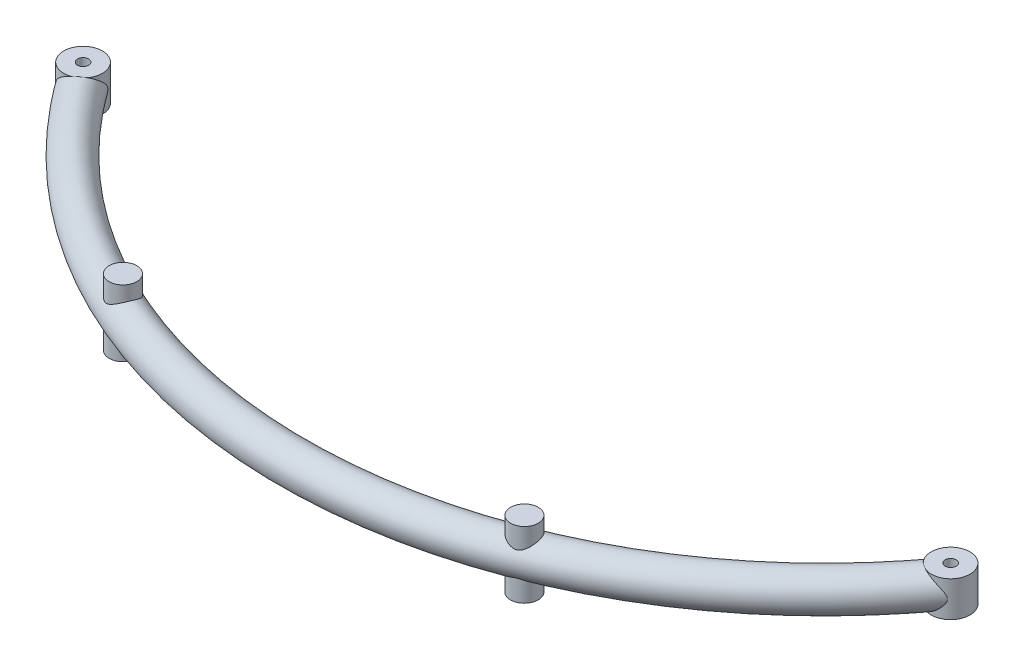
ISO-10303-21;
HEADER;
FILE_DESCRIPTION(('STEP AP214'),'2;1');
FILE_NAME('part.step','',(''),(''),'','','');
FILE_SCHEMA(('AUTOMOTIVE_DESIGN { 1 0 10303 214 1 1 1 1 }'));
ENDSEC;
DATA;
#1=APPLICATION_CONTEXT('core data for automotive mechanical design processes');
#2=APPLICATION_PROTOCOL_DEFINITION('international standard','automotive_design',2000,#1);
#3=PRODUCT_CONTEXT('',#1,'mechanical');
#4=PRODUCT('Part','Part','',(#3));
#5=PRODUCT_RELATED_PRODUCT_CATEGORY('part','',(#4));
#6=PRODUCT_DEFINITION_FORMATION('','',#4);
#7=PRODUCT_DEFINITION_CONTEXT('part definition',#1,'design');
#8=PRODUCT_DEFINITION('design','',#6,#7);
#9=PRODUCT_DEFINITION_SHAPE('','',#8);
#10=(LENGTH_UNIT() NAMED_UNIT(*) SI_UNIT(.MILLI.,.METRE.));
#11=(NAMED_UNIT(*) PLANE_ANGLE_UNIT() SI_UNIT($,.RADIAN.));
#12=(NAMED_UNIT(*) SI_UNIT($,.STERADIAN.) SOLID_ANGLE_UNIT());
#13=UNCERTAINTY_MEASURE_WITH_UNIT(LENGTH_MEASURE(1.E-05),#10,'distance_accuracy_value','');
#14=(GEOMETRIC_REPRESENTATION_CONTEXT(3) GLOBAL_UNCERTAINTY_ASSIGNED_CONTEXT((#13)) GLOBAL_UNIT_ASSIGNED_CONTEXT((#10,
#11,#12)) REPRESENTATION_CONTEXT('',''));
#15=CARTESIAN_POINT('',(0.,0.,0.));
#16=DIRECTION('',(0.,0.,1.));
#17=DIRECTION('',(1.,0.,0.));
#18=AXIS2_PLACEMENT_3D('',#15,#16,#17);
#19=CARTESIAN_POINT('',(175.897992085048,-30.,446.609333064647));
#20=DIRECTION('',(0.,1.,0.));
#21=DIRECTION('',(0.,0.,1.));
#22=AXIS2_PLACEMENT_3D('',#19,#20,#21);
#23=CYLINDRICAL_SURFACE('',#22,12.5);
#24=CARTESIAN_POINT('',(175.897992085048,-30.,446.609333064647));
#25=DIRECTION('',(0.,1.,0.));
#26=DIRECTION('',(0.,0.,1.));
#27=AXIS2_PLACEMENT_3D('',#24,#25,#26);
#28=CIRCLE('',#27,12.5);
#29=CARTESIAN_POINT('',(175.897992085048,-30.,459.109333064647));
#30=VERTEX_POINT('',#29);
#31=EDGE_CURVE('E11',#30,#30,#28,.T.);
#32=ORIENTED_EDGE('',*,*,#31,.T.);
#33=EDGE_LOOP('',(#32));
#34=FACE_BOUND('',#33,.T.);
#35=CARTESIAN_POINT('',(175.897992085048,30.,446.609333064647));
#36=DIRECTION('',(0.,1.,0.));
#37=DIRECTION('',(0.,0.,1.));
#38=AXIS2_PLACEMENT_3D('',#35,#36,#37);
#39=CIRCLE('',#38,12.5);
#40=CARTESIAN_POINT('',(175.897992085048,30.,459.109333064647));
#41=VERTEX_POINT('',#40);
#42=EDGE_CURVE('E45',#41,#41,#39,.T.);
#43=ORIENTED_EDGE('',*,*,#42,.F.);
#44=EDGE_LOOP('',(#43));
#45=FACE_BOUND('',#44,.T.);
#46=ADVANCED_FACE('F39',(#34,#45),#23,.T.);
#47=CARTESIAN_POINT('',(175.897992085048,-30.,446.609333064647));
#48=DIRECTION('',(0.,1.,0.));
#49=DIRECTION('',(0.,0.,1.));
#50=AXIS2_PLACEMENT_3D('',#47,#48,#49);
#51=PLANE('',#50);
#52=ORIENTED_EDGE('',*,*,#31,.F.);
#53=EDGE_LOOP('',(#52));
#54=FACE_BOUND('',#53,.T.);
#55=ADVANCED_FACE('F54',(#54),#51,.F.);
#56=CARTESIAN_POINT('',(175.897992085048,30.,446.609333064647));
#57=DIRECTION('',(0.,1.,0.));
#58=DIRECTION('',(0.,0.,1.));
#59=AXIS2_PLACEMENT_3D('',#56,#57,#58);
#60=PLANE('',#59);
#61=ORIENTED_EDGE('',*,*,#42,.T.);
#62=EDGE_LOOP('',(#61));
#63=FACE_BOUND('',#62,.T.);
#64=ADVANCED_FACE('F51',(#63),#60,.T.);
#65=CLOSED_SHELL('',(#46,#55,#64));
#66=MANIFOLD_SOLID_BREP('B2',#65);
#67=CARTESIAN_POINT('',(-194.229587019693,-30.,438.947454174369));
#68=DIRECTION('',(0.,1.,0.));
#69=DIRECTION('',(0.,0.,1.));
#70=AXIS2_PLACEMENT_3D('',#67,#68,#69);
#71=CYLINDRICAL_SURFACE('',#70,12.5);
#72=CARTESIAN_POINT('',(-194.229587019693,-30.,438.947454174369));
#73=DIRECTION('',(0.,1.,0.));
#74=DIRECTION('',(0.,0.,1.));
#75=AXIS2_PLACEMENT_3D('',#72,#73,#74);
#76=CIRCLE('',#75,12.5);
#77=CARTESIAN_POINT('',(-194.229587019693,-30.,451.447454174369));
#78=VERTEX_POINT('',#77);
#79=EDGE_CURVE('E38',#78,#78,#76,.T.);
#80=ORIENTED_EDGE('',*,*,#79,.T.);
#81=EDGE_LOOP('',(#80));
#82=FACE_BOUND('',#81,.T.);
#83=CARTESIAN_POINT('',(-194.229587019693,30.,438.947454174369));
#84=DIRECTION('',(0.,1.,0.));
#85=DIRECTION('',(0.,0.,1.));
#86=AXIS2_PLACEMENT_3D('',#83,#84,#85);
#87=CIRCLE('',#86,12.5);
#88=CARTESIAN_POINT('',(-194.229587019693,30.,451.447454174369));
#89=VERTEX_POINT('',#88);
#90=EDGE_CURVE('E96',#89,#89,#87,.T.);
#91=ORIENTED_EDGE('',*,*,#90,.F.);
#92=EDGE_LOOP('',(#91));
#93=FACE_BOUND('',#92,.T.);
#94=ADVANCED_FACE('F90',(#82,#93),#71,.T.);
#95=CARTESIAN_POINT('',(-194.229587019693,-30.,438.947454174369));
#96=DIRECTION('',(0.,1.,0.));
#97=DIRECTION('',(0.,0.,1.));
#98=AXIS2_PLACEMENT_3D('',#95,#96,#97);
#99=PLANE('',#98);
#100=ORIENTED_EDGE('',*,*,#79,.F.);
#101=EDGE_LOOP('',(#100));
#102=FACE_BOUND('',#101,.T.);
#103=ADVANCED_FACE('F105',(#102),#99,.F.);
#104=CARTESIAN_POINT('',(-194.229587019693,30.,438.947454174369));
#105=DIRECTION('',(0.,1.,0.));
#106=DIRECTION('',(0.,0.,1.));
#107=AXIS2_PLACEMENT_3D('',#104,#105,#106);
#108=PLANE('',#107);
#109=ORIENTED_EDGE('',*,*,#90,.T.);
#110=EDGE_LOOP('',(#109));
#111=FACE_BOUND('',#110,.T.);
#112=ADVANCED_FACE('F102',(#111),#108,.T.);
#113=CLOSED_SHELL('',(#94,#103,#112));
#114=MANIFOLD_SOLID_BREP('B6',#113);
#115=CARTESIAN_POINT('',(0.,0.,0.));
#116=DIRECTION('',(0.,1.,0.));
#117=DIRECTION('',(0.,0.,1.));
#118=AXIS2_PLACEMENT_3D('',#115,#116,#117);
#119=TOROIDAL_SURFACE('',#118,480.,14.35);
#120=CARTESIAN_POINT('',(374.137719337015,0.,277.21992978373));
#121=CARTESIAN_POINT('',(374.137717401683,0.263774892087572,277.219937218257));
#122=CARTESIAN_POINT('',(374.137483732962,0.527630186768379,277.232498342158));
#123=CARTESIAN_POINT('',(374.136715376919,1.05311406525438,277.282208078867));
#124=CARTESIAN_POINT('',(374.136180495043,1.31474109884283,277.319372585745));
#125=CARTESIAN_POINT('',(374.135288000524,1.83432753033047,277.416865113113));
#126=CARTESIAN_POINT('',(374.134930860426,2.09227539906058,277.477254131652));
#127=CARTESIAN_POINT('',(374.135091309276,2.60237591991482,277.618990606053));
#128=CARTESIAN_POINT('',(374.135609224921,2.85452637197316,277.700345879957));
#129=CARTESIAN_POINT('',(374.13883239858,3.44411508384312,277.915074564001));
#130=CARTESIAN_POINT('',(374.14227593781,3.77859789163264,278.056557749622));
#131=CARTESIAN_POINT('',(374.154461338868,4.43386771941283,278.368099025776));
#132=CARTESIAN_POINT('',(374.163205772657,4.75464801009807,278.538170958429));
#133=CARTESIAN_POINT('',(374.188037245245,5.38313737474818,278.902040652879));
#134=CARTESIAN_POINT('',(374.204142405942,5.69081212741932,279.095896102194));
#135=CARTESIAN_POINT('',(374.245519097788,6.29250391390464,279.502709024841));
#136=CARTESIAN_POINT('',(374.270790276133,6.58652147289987,279.715665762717));
#137=CARTESIAN_POINT('',(374.34395650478,7.27187095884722,280.242277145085));
#138=CARTESIAN_POINT('',(374.396814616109,7.65714133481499,280.563161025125));
#139=CARTESIAN_POINT('',(374.527212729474,8.40272516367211,281.228239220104));
#140=CARTESIAN_POINT('',(374.604762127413,8.76302905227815,281.572442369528));
#141=CARTESIAN_POINT('',(374.788014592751,9.45772262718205,282.278368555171));
#142=CARTESIAN_POINT('',(374.893689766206,9.79213756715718,282.640073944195));
#143=CARTESIAN_POINT('',(375.13653336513,10.4338917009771,283.376577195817));
#144=CARTESIAN_POINT('',(375.273690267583,10.741240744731,283.751370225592));
#145=CARTESIAN_POINT('',(375.549615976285,11.2640806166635,284.428728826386));
#146=CARTESIAN_POINT('',(375.681805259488,11.4851843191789,284.729655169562));
#147=CARTESIAN_POINT('',(375.968902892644,11.9075820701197,285.334539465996));
#148=CARTESIAN_POINT('',(376.123806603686,12.1088801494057,285.63849678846));
#149=CARTESIAN_POINT('',(376.45726287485,12.489590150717,286.24659004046));
#150=CARTESIAN_POINT('',(376.635787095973,12.6690278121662,286.550725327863));
#151=CARTESIAN_POINT('',(377.017388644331,13.0041546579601,287.156693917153));
#152=CARTESIAN_POINT('',(377.220461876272,13.1598477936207,287.458527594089));
#153=CARTESIAN_POINT('',(377.616394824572,13.4220476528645,288.008122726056));
#154=CARTESIAN_POINT('',(377.80555430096,13.5324359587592,288.256702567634));
#155=CARTESIAN_POINT('',(378.201068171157,13.7336610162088,288.748000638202));
#156=CARTESIAN_POINT('',(378.40741925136,13.8245015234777,288.990719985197));
#157=CARTESIAN_POINT('',(378.836703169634,13.985405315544,289.468132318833));
#158=CARTESIAN_POINT('',(379.05963045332,14.055475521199,289.702827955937));
#159=CARTESIAN_POINT('',(379.521145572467,14.1738565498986,290.162130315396));
#160=CARTESIAN_POINT('',(379.759733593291,14.2221671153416,290.386736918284));
#161=CARTESIAN_POINT('',(380.25202123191,14.2964170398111,290.824540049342));
#162=CARTESIAN_POINT('',(380.505771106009,14.3222770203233,291.037693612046));
#163=CARTESIAN_POINT('',(381.025797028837,14.3509518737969,291.449807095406));
#164=CARTESIAN_POINT('',(381.292073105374,14.3537666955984,291.648766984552));
#165=CARTESIAN_POINT('',(381.835029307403,14.336373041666,292.030865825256));
#166=CARTESIAN_POINT('',(382.111709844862,14.3161636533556,292.214004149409));
#167=CARTESIAN_POINT('',(382.673138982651,14.2531441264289,292.563195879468));
#168=CARTESIAN_POINT('',(382.957887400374,14.2103344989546,292.729249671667));
#169=CARTESIAN_POINT('',(383.517341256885,14.1058362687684,293.034863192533));
#170=CARTESIAN_POINT('',(383.79174580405,14.0453064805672,293.175374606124));
#171=CARTESIAN_POINT('',(384.343649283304,13.905642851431,293.440051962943));
#172=CARTESIAN_POINT('',(384.621148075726,13.8265098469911,293.564218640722));
#173=CARTESIAN_POINT('',(385.177386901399,13.650677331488,293.796186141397));
#174=CARTESIAN_POINT('',(385.456126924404,13.5539779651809,293.903987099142));
#175=CARTESIAN_POINT('',(386.013249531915,13.3440930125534,294.103512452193));
#176=CARTESIAN_POINT('',(386.291631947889,13.2309013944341,294.195230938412));
#177=CARTESIAN_POINT('',(386.873494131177,12.9773916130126,294.371204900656));
#178=CARTESIAN_POINT('',(387.176773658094,12.8355044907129,294.453860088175));
#179=CARTESIAN_POINT('',(387.779309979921,12.5346451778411,294.601207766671));
#180=CARTESIAN_POINT('',(388.078565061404,12.37566595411,294.665892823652));
#181=CARTESIAN_POINT('',(388.671439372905,12.0419781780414,294.778304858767));
#182=CARTESIAN_POINT('',(388.965058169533,11.8672684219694,294.826030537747));
#183=CARTESIAN_POINT('',(389.545340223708,11.5032794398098,294.905683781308));
#184=CARTESIAN_POINT('',(389.832002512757,11.3139982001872,294.937609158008));
#185=CARTESIAN_POINT('',(390.456424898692,10.8807451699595,294.992063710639));
#186=CARTESIAN_POINT('',(390.792299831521,10.6336263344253,295.011220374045));
#187=CARTESIAN_POINT('',(391.450192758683,10.1208669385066,295.030544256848));
#188=CARTESIAN_POINT('',(391.77220855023,9.85522345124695,295.030708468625));
#189=CARTESIAN_POINT('',(392.400850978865,9.30597293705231,295.014489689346));
#190=CARTESIAN_POINT('',(392.707456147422,9.02234203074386,294.998084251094));
#191=CARTESIAN_POINT('',(393.302672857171,8.43792327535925,294.951339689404));
#192=CARTESIAN_POINT('',(393.591286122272,8.13713707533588,294.921001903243));
#193=CARTESIAN_POINT('',(394.134143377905,7.5338172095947,294.851109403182));
#194=CARTESIAN_POINT('',(394.389383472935,7.23211815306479,294.812089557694));
#195=CARTESIAN_POINT('',(394.878676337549,6.61279311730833,294.726977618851));
#196=CARTESIAN_POINT('',(395.112725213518,6.29516422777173,294.680884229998));
#197=CARTESIAN_POINT('',(395.555592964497,5.6440167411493,294.585100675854));
#198=CARTESIAN_POINT('',(395.764453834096,5.31052592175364,294.535416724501));
#199=CARTESIAN_POINT('',(396.152567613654,4.62669844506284,294.436460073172));
#200=CARTESIAN_POINT('',(396.331837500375,4.27637159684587,294.387187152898));
#201=CARTESIAN_POINT('',(396.597111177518,3.68681983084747,294.310534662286));
#202=CARTESIAN_POINT('',(396.693585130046,3.4524923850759,294.281610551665));
#203=CARTESIAN_POINT('',(396.869803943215,2.97725055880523,294.227386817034));
#204=CARTESIAN_POINT('',(396.949554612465,2.73633849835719,294.202085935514));
#205=CARTESIAN_POINT('',(397.090216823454,2.24908918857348,294.156596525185));
#206=CARTESIAN_POINT('',(397.151166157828,2.00276390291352,294.136397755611));
#207=CARTESIAN_POINT('',(397.252570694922,1.50545727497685,294.102373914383));
#208=CARTESIAN_POINT('',(397.293026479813,1.25447606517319,294.088548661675));
#209=CARTESIAN_POINT('',(397.352249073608,0.747386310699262,294.068197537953));
#210=CARTESIAN_POINT('',(397.370821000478,0.491252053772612,294.061737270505));
#211=CARTESIAN_POINT('',(397.384874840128,-0.0217224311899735,294.056855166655));
#212=CARTESIAN_POINT('',(397.380357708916,-0.278562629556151,294.058432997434));
#213=CARTESIAN_POINT('',(397.348407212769,-0.790848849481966,294.06950298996));
#214=CARTESIAN_POINT('',(397.320954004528,-1.04629347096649,294.079002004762));
#215=CARTESIAN_POINT('',(397.244182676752,-1.5534904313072,294.105176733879));
#216=CARTESIAN_POINT('',(397.194861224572,-1.80524220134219,294.121853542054));
#217=CARTESIAN_POINT('',(397.064951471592,-2.3499609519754,294.164865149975));
#218=CARTESIAN_POINT('',(396.980244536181,-2.64184626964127,294.192421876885));
#219=CARTESIAN_POINT('',(396.785792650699,-3.21645834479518,294.253546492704));
#220=CARTESIAN_POINT('',(396.676041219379,-3.49918270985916,294.287115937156));
#221=CARTESIAN_POINT('',(396.434542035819,-4.0554286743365,294.357871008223));
#222=CARTESIAN_POINT('',(396.302736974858,-4.32892400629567,294.395065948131));
#223=CARTESIAN_POINT('',(396.020315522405,-4.86577568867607,294.470692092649));
#224=CARTESIAN_POINT('',(395.869697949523,-5.12913140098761,294.509123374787));
#225=CARTESIAN_POINT('',(395.46362904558,-5.78995519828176,294.606366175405));
#226=CARTESIAN_POINT('',(395.196531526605,-6.18037436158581,294.664600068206));
#227=CARTESIAN_POINT('',(394.629908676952,-6.938228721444,294.772667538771));
#228=CARTESIAN_POINT('',(394.330366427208,-7.30565176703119,294.822496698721));
#229=CARTESIAN_POINT('',(393.703623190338,-8.0185664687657,294.908615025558));
#230=CARTESIAN_POINT('',(393.376388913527,-8.36403082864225,294.944887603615));
#231=CARTESIAN_POINT('',(392.698484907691,-9.03252597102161,294.999391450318));
#232=CARTESIAN_POINT('',(392.347819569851,-9.35556093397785,295.017626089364));
#233=CARTESIAN_POINT('',(391.614237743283,-9.98882388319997,295.032383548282));
#234=CARTESIAN_POINT('',(391.230640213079,-10.2982825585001,295.028173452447));
#235=CARTESIAN_POINT('',(390.444762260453,-10.8910231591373,294.992333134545));
#236=CARTESIAN_POINT('',(390.042478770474,-11.1743007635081,294.960698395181));
#237=CARTESIAN_POINT('',(389.223530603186,-11.7114801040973,294.866369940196));
#238=CARTESIAN_POINT('',(388.806902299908,-11.9654499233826,294.803750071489));
#239=CARTESIAN_POINT('',(387.962201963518,-12.4414376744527,294.644063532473));
#240=CARTESIAN_POINT('',(387.534135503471,-12.6634708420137,294.54701336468));
#241=CARTESIAN_POINT('',(386.79980851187,-13.0108386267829,294.350117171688));
#242=CARTESIAN_POINT('',(386.495277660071,-13.1452682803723,294.259729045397));
#243=CARTESIAN_POINT('',(385.88469173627,-13.3950149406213,294.059821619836));
#244=CARTESIAN_POINT('',(385.578637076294,-13.5103368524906,293.9503072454));
#245=CARTESIAN_POINT('',(384.967233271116,-13.7203467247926,293.711704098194));
#246=CARTESIAN_POINT('',(384.661883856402,-13.8150446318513,293.582624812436));
#247=CARTESIAN_POINT('',(384.054105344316,-13.9824576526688,293.304726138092));
#248=CARTESIAN_POINT('',(383.751676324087,-14.0551721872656,293.155906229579));
#249=CARTESIAN_POINT('',(383.150551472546,-14.1777288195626,292.837912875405));
#250=CARTESIAN_POINT('',(382.851888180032,-14.2274334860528,292.668624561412));
#251=CARTESIAN_POINT('',(382.262842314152,-14.3023687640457,292.311230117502));
#252=CARTESIAN_POINT('',(381.972459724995,-14.3275994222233,292.123124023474));
#253=CARTESIAN_POINT('',(381.402700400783,-14.3530266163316,291.729478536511));
#254=CARTESIAN_POINT('',(381.123321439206,-14.3532282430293,291.523942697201));
#255=CARTESIAN_POINT('',(380.577973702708,-14.3285223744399,291.097213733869));
#256=CARTESIAN_POINT('',(380.312004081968,-14.3036164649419,290.876021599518));
#257=CARTESIAN_POINT('',(379.818995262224,-14.2324832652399,290.440828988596));
#258=CARTESIAN_POINT('',(379.590612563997,-14.188393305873,290.227994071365));
#259=CARTESIAN_POINT('',(379.147916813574,-14.0804078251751,289.792969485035));
#260=CARTESIAN_POINT('',(378.933602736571,-14.0165137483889,289.57078049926));
#261=CARTESIAN_POINT('',(378.519928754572,-13.8697703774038,289.118885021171));
#262=CARTESIAN_POINT('',(378.320569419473,-13.7869203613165,288.889178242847));
#263=CARTESIAN_POINT('',(377.937355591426,-13.6032882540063,288.424082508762));
#264=CARTESIAN_POINT('',(377.753501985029,-13.5025051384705,288.188693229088));
#265=CARTESIAN_POINT('',(377.392723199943,-13.2786557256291,287.702107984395));
#266=CARTESIAN_POINT('',(377.216606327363,-13.1547261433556,287.450710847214));
#267=CARTESIAN_POINT('',(376.881683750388,-12.889661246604,286.945512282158));
#268=CARTESIAN_POINT('',(376.722878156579,-12.7485258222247,286.691710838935));
#269=CARTESIAN_POINT('',(376.422175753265,-12.4502672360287,286.18332186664));
#270=CARTESIAN_POINT('',(376.280286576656,-12.2931369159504,285.928734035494));
#271=CARTESIAN_POINT('',(376.012944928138,-11.9641196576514,285.420440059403));
#272=CARTESIAN_POINT('',(375.887495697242,-11.7922298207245,285.166734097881));
#273=CARTESIAN_POINT('',(375.598498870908,-11.3528609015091,284.545942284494));
#274=CARTESIAN_POINT('',(375.443820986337,-11.0776614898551,284.180153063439));
#275=CARTESIAN_POINT('',(375.165494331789,-10.500836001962,283.457622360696));
#276=CARTESIAN_POINT('',(375.041858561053,-10.1991989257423,283.100884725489));
#277=CARTESIAN_POINT('',(374.822655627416,-9.5708370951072,282.399792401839));
#278=CARTESIAN_POINT('',(374.727147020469,-9.24406176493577,282.055464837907));
#279=CARTESIAN_POINT('',(374.561571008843,-8.56715827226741,281.384253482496));
#280=CARTESIAN_POINT('',(374.491497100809,-8.21703610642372,281.057365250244));
#281=CARTESIAN_POINT('',(374.383375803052,-7.55394888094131,280.47853443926));
#282=CARTESIAN_POINT('',(374.341938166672,-7.24450734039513,280.223177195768));
#283=CARTESIAN_POINT('',(374.272454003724,-6.60926654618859,279.731514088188));
#284=CARTESIAN_POINT('',(374.244409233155,-6.2834651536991,279.495210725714));
#285=CARTESIAN_POINT('',(374.199540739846,-5.61585009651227,279.046785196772));
#286=CARTESIAN_POINT('',(374.182692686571,-5.27407288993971,278.834611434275));
#287=CARTESIAN_POINT('',(374.157631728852,-4.57356614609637,278.439842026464));
#288=CARTESIAN_POINT('',(374.149413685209,-4.21484683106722,278.257228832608));
#289=CARTESIAN_POINT('',(374.14060549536,-3.60495008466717,277.984515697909));
#290=CARTESIAN_POINT('',(374.138375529,-3.35843456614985,277.88401551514));
#291=CARTESIAN_POINT('',(374.135620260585,-2.85861290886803,277.701691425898));
#292=CARTESIAN_POINT('',(374.135094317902,-2.60530935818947,277.619860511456));
#293=CARTESIAN_POINT('',(374.134929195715,-2.09356906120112,277.477559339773));
#294=CARTESIAN_POINT('',(374.135287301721,-1.8351504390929,277.417024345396));
#295=CARTESIAN_POINT('',(374.136180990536,-1.31403512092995,277.319235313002));
#296=CARTESIAN_POINT('',(374.136716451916,-1.05134146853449,277.281965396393));
#297=CARTESIAN_POINT('',(374.137295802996,-0.656676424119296,277.244743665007));
#298=CARTESIAN_POINT('',(374.137451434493,-0.525534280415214,277.235450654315));
#299=CARTESIAN_POINT('',(374.137663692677,-0.26293478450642,277.223041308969));
#300=CARTESIAN_POINT('',(374.137720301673,-0.131477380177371,277.219926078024));
#301=CARTESIAN_POINT('',(374.137719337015,0.,277.21992978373));
#302=B_SPLINE_CURVE_WITH_KNOTS('',3,(#120,#121,#122,#123,#124,#125,#126,#127,#128,#129,#130,
#131,#132,#133,#134,#135,#136,#137,#138,#139,#140,#141,#142,#143,#144,#145,#146,#147,#148,#149,
#150,#151,#152,#153,#154,#155,#156,#157,#158,#159,#160,#161,#162,#163,#164,#165,#166,#167,#168,
#169,#170,#171,#172,#173,#174,#175,#176,#177,#178,#179,#180,#181,#182,#183,#184,#185,#186,#187,
#188,#189,#190,#191,#192,#193,#194,#195,#196,#197,#198,#199,#200,#201,#202,#203,#204,#205,#206,
#207,#208,#209,#210,#211,#212,#213,#214,#215,#216,#217,#218,#219,#220,#221,#222,#223,#224,#225,
#226,#227,#228,#229,#230,#231,#232,#233,#234,#235,#236,#237,#238,#239,#240,#241,#242,#243,#244,
#245,#246,#247,#248,#249,#250,#251,#252,#253,#254,#255,#256,#257,#258,#259,#260,#261,#262,#263,
#264,#265,#266,#267,#268,#269,#270,#271,#272,#273,#274,#275,#276,#277,#278,#279,#280,#281,#282,
#283,#284,#285,#286,#287,#288,#289,#290,#291,#292,#293,#294,#295,#296,#297,#298,#299,#300,#301),
.UNSPECIFIED.,.T.,.F.,(4,2,2,2,2,2,2,2,2,2,2,2,2,2,2,2,2,2,2,2,2,2,2,2,2,2,2,2,2,2,2,2,2,2,2,2,
2,2,2,2,2,2,2,2,2,2,2,2,2,2,2,2,2,2,2,2,2,2,2,2,2,2,2,2,2,2,2,2,2,2,2,2,2,2,2,2,2,2,2,2,2,2,2,2,
2,2,2,2,2,2,4),(0.,0.791172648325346,1.5828569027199,2.37663483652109,3.1707091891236,
4.25853259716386,5.34688423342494,6.43792991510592,7.52893360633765,9.03952389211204,
10.5506896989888,12.0603623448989,13.569483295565,14.7568219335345,15.9439184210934,
17.1296033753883,18.3150908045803,19.3079889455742,20.3006961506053,21.2930722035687,
22.2854600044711,23.2813424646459,24.2772271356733,25.2731512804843,26.269052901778,
27.2105613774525,28.1520275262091,29.0934859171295,30.0352895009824,31.0689466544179,
32.1030307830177,33.1371941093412,34.1715005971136,35.4226212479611,36.6739400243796,
37.9269562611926,39.1798522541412,40.3702898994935,41.5609458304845,42.7495883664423,
43.9375465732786,44.7021563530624,45.4665001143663,46.2292973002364,46.9920728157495,
47.7615909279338,48.5310771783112,49.3012298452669,50.0714999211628,50.9855977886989,
51.8999324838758,52.8166811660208,53.7334874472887,55.1612060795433,56.5896728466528,
58.0198819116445,59.4498236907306,60.9267393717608,62.4038983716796,63.8775536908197,
65.3505036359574,66.3843617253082,67.4179539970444,68.4510466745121,69.4841665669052,
70.523379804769,71.5625910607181,72.6015909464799,73.6405252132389,74.5852847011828,
75.5299752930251,76.4747018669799,77.4194824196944,78.4115859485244,79.4036958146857,
80.3962516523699,81.3890028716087,82.8364862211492,84.2845747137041,85.7356569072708,
87.1863678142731,88.3954622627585,89.6047151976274,90.8113317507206,92.0172293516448,
92.8152697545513,93.6130100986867,94.408304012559,95.2030545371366,95.5973404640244,
95.9916968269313),.UNSPECIFIED.);
#303=CARTESIAN_POINT('',(374.137719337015,0.,277.21992978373));
#304=VERTEX_POINT('',#303);
#305=EDGE_CURVE('E158',#304,#304,#302,.T.);
#306=ORIENTED_EDGE('',*,*,#305,.T.);
#307=EDGE_LOOP('',(#306));
#308=FACE_BOUND('',#307,.T.);
#309=CARTESIAN_POINT('',(-397.38106412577,0.,294.058178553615));
#310=CARTESIAN_POINT('',(-397.381067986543,-0.256898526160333,294.058176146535));
#311=CARTESIAN_POINT('',(-397.369471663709,-0.51377767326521,294.062221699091));
#312=CARTESIAN_POINT('',(-397.323573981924,-1.02522499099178,294.078069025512));
#313=CARTESIAN_POINT('',(-397.289273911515,-1.27979329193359,294.089870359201));
#314=CARTESIAN_POINT('',(-397.199159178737,-1.78527578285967,294.120362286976));
#315=CARTESIAN_POINT('',(-397.14329188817,-2.03617946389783,294.139069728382));
#316=CARTESIAN_POINT('',(-397.011885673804,-2.53232111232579,294.182069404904));
#317=CARTESIAN_POINT('',(-396.936339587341,-2.77755698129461,294.206363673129));
#318=CARTESIAN_POINT('',(-396.736174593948,-3.35162378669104,294.268876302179));
#319=CARTESIAN_POINT('',(-396.603760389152,-3.67754068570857,294.308909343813));
#320=CARTESIAN_POINT('',(-396.310853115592,-4.31594745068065,294.392872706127));
#321=CARTESIAN_POINT('',(-396.150347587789,-4.62843128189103,294.43680475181));
#322=CARTESIAN_POINT('',(-395.805221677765,-5.2406487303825,294.525220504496));
#323=CARTESIAN_POINT('',(-395.620542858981,-5.54034903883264,294.569705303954));
#324=CARTESIAN_POINT('',(-395.230889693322,-6.12652051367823,294.656164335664));
#325=CARTESIAN_POINT('',(-395.025915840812,-6.41299200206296,294.698138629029));
#326=CARTESIAN_POINT('',(-394.505832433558,-7.09446817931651,294.79414787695));
#327=CARTESIAN_POINT('',(-394.181447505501,-7.48279262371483,294.845541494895));
#328=CARTESIAN_POINT('',(-393.502460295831,-8.23417638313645,294.931870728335));
#329=CARTESIAN_POINT('',(-393.147845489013,-8.59722511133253,294.966799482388));
#330=CARTESIAN_POINT('',(-392.41311279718,-9.29756894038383,295.014991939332));
#331=CARTESIAN_POINT('',(-392.033012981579,-9.63488193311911,295.028270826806));
#332=CARTESIAN_POINT('',(-391.250821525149,-10.2828254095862,295.028576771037));
#333=CARTESIAN_POINT('',(-390.848737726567,-10.5934653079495,295.015613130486));
#334=CARTESIAN_POINT('',(-390.107521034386,-11.1272931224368,294.964771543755));
#335=CARTESIAN_POINT('',(-389.771700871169,-11.3556131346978,294.93233913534));
#336=CARTESIAN_POINT('',(-389.089957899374,-11.792278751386,294.845780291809));
#337=CARTESIAN_POINT('',(-388.74403543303,-12.0006250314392,294.791654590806));
#338=CARTESIAN_POINT('',(-388.044717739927,-12.395183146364,294.659867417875));
#339=CARTESIAN_POINT('',(-387.691333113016,-12.5814241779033,294.58223748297));
#340=CARTESIAN_POINT('',(-386.97919030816,-12.9298843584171,294.401725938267));
#341=CARTESIAN_POINT('',(-386.620433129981,-13.0921079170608,294.298848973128));
#342=CARTESIAN_POINT('',(-385.963158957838,-13.3642246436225,294.086742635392));
#343=CARTESIAN_POINT('',(-385.665013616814,-13.4783123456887,293.981727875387));
#344=CARTESIAN_POINT('',(-385.069073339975,-13.6870774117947,293.753110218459));
#345=CARTESIAN_POINT('',(-384.77127834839,-13.7817584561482,293.629510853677));
#346=CARTESIAN_POINT('',(-384.178278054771,-13.950368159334,293.363602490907));
#347=CARTESIAN_POINT('',(-383.88307188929,-14.0243040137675,293.221300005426));
#348=CARTESIAN_POINT('',(-383.297496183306,-14.150287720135,292.918185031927));
#349=CARTESIAN_POINT('',(-383.007126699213,-14.2023353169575,292.757372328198));
#350=CARTESIAN_POINT('',(-382.432436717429,-14.2837869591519,292.417172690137));
#351=CARTESIAN_POINT('',(-382.148148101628,-14.3130913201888,292.237707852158));
#352=CARTESIAN_POINT('',(-381.589408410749,-14.3480851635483,291.861932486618));
#353=CARTESIAN_POINT('',(-381.31495735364,-14.3537746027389,291.66562192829));
#354=CARTESIAN_POINT('',(-380.77823103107,-14.3413600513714,291.257743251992));
#355=CARTESIAN_POINT('',(-380.515954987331,-14.3232575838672,291.0461761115));
#356=CARTESIAN_POINT('',(-380.005594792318,-14.2635170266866,290.609696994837));
#357=CARTESIAN_POINT('',(-379.757510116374,-14.221879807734,290.384785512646));
#358=CARTESIAN_POINT('',(-379.293837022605,-14.119423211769,289.939779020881));
#359=CARTESIAN_POINT('',(-379.077188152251,-14.0601346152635,289.720431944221));
#360=CARTESIAN_POINT('',(-378.658563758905,-13.9225556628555,289.273882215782));
#361=CARTESIAN_POINT('',(-378.456587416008,-13.8442663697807,289.046680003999));
#362=CARTESIAN_POINT('',(-378.067926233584,-13.6696657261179,288.58624084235));
#363=CARTESIAN_POINT('',(-377.881241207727,-13.5733545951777,288.353003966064));
#364=CARTESIAN_POINT('',(-377.52339353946,-13.3637645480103,287.882170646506));
#365=CARTESIAN_POINT('',(-377.352236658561,-13.2504793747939,287.644572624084));
#366=CARTESIAN_POINT('',(-377.012154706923,-12.9981689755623,287.147179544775));
#367=CARTESIAN_POINT('',(-376.844559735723,-12.8577956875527,286.887159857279));
#368=CARTESIAN_POINT('',(-376.527301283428,-12.5598968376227,286.365879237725));
#369=CARTESIAN_POINT('',(-376.377645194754,-12.4023642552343,286.104617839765));
#370=CARTESIAN_POINT('',(-376.095801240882,-12.0715077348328,285.582695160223));
#371=CARTESIAN_POINT('',(-375.963613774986,-11.898183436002,285.322033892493));
#372=CARTESIAN_POINT('',(-375.71598608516,-11.5369123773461,284.802882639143));
#373=CARTESIAN_POINT('',(-375.600548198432,-11.3489635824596,284.544392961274));
#374=CARTESIAN_POINT('',(-375.363598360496,-10.9196006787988,283.978528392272));
#375=CARTESIAN_POINT('',(-375.245678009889,-10.6751164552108,283.671975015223));
#376=CARTESIAN_POINT('',(-375.031332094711,-10.1678242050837,283.066596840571));
#377=CARTESIAN_POINT('',(-374.934909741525,-9.90501344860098,282.767773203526));
#378=CARTESIAN_POINT('',(-374.761710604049,-9.36169923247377,282.179889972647));
#379=CARTESIAN_POINT('',(-374.684962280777,-9.0811708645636,281.890845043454));
#380=CARTESIAN_POINT('',(-374.549456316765,-8.50336486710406,281.325613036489));
#381=CARTESIAN_POINT('',(-374.49069734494,-8.20608847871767,281.04942500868));
#382=CARTESIAN_POINT('',(-374.390002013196,-7.59971167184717,280.51711196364));
#383=CARTESIAN_POINT('',(-374.347816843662,-7.29086900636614,280.260740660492));
#384=CARTESIAN_POINT('',(-374.276958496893,-6.6568134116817,279.76686497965));
#385=CARTESIAN_POINT('',(-374.248287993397,-6.33159725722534,279.529364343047));
#386=CARTESIAN_POINT('',(-374.202287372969,-5.66498360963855,279.078213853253));
#387=CARTESIAN_POINT('',(-374.184938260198,-5.32361425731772,278.864524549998));
#388=CARTESIAN_POINT('',(-374.159022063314,-4.62388775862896,278.466474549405));
#389=CARTESIAN_POINT('',(-374.150449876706,-4.2655406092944,278.282096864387));
#390=CARTESIAN_POINT('',(-374.141258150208,-3.66155175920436,278.008637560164));
#391=CARTESIAN_POINT('',(-374.138899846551,-3.42075259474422,277.908885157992));
#392=CARTESIAN_POINT('',(-374.135891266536,-2.93258756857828,277.727063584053));
#393=CARTESIAN_POINT('',(-374.135240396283,-2.68522402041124,277.644988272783));
#394=CARTESIAN_POINT('',(-374.134873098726,-2.18521071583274,277.500994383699));
#395=CARTESIAN_POINT('',(-374.135154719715,-1.93257309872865,277.439034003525));
#396=CARTESIAN_POINT('',(-374.135970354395,-1.42284877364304,277.337184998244));
#397=CARTESIAN_POINT('',(-374.136504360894,-1.16576219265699,277.297295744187));
#398=CARTESIAN_POINT('',(-374.137337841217,-0.646902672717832,277.240960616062));
#399=CARTESIAN_POINT('',(-374.137635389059,-0.385108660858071,277.224706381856));
#400=CARTESIAN_POINT('',(-374.13777127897,0.138839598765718,277.216971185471));
#401=CARTESIAN_POINT('',(-374.137609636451,0.400993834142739,277.225489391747));
#402=CARTESIAN_POINT('',(-374.136941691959,0.923619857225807,277.266938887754));
#403=CARTESIAN_POINT('',(-374.136435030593,1.18408960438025,277.299895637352));
#404=CARTESIAN_POINT('',(-374.135500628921,1.70104866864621,277.388861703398));
#405=CARTESIAN_POINT('',(-374.135072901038,1.95753735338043,277.444874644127));
#406=CARTESIAN_POINT('',(-374.134929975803,2.51886080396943,277.592015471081));
#407=CARTESIAN_POINT('',(-374.135385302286,2.82240083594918,277.688073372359));
#408=CARTESIAN_POINT('',(-374.138749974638,3.41968396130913,277.906784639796));
#409=CARTESIAN_POINT('',(-374.141660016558,3.71342425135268,278.029445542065));
#410=CARTESIAN_POINT('',(-374.151393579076,4.29111872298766,278.297530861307));
#411=CARTESIAN_POINT('',(-374.158227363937,4.57504515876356,278.443014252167));
#412=CARTESIAN_POINT('',(-374.177194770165,5.13216741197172,278.752824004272));
#413=CARTESIAN_POINT('',(-374.189328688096,5.40536262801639,278.917151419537));
#414=CARTESIAN_POINT('',(-374.228158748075,6.07983611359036,279.350656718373));
#415=CARTESIAN_POINT('',(-374.259140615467,6.4742868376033,279.630109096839));
#416=CARTESIAN_POINT('',(-374.340214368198,7.23979710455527,280.216978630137));
#417=CARTESIAN_POINT('',(-374.390315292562,7.61084548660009,280.52440895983));
#418=CARTESIAN_POINT('',(-374.513175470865,8.33020865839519,281.16139627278));
#419=CARTESIAN_POINT('',(-374.585960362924,8.67849718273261,281.490977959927));
#420=CARTESIAN_POINT('',(-374.75735129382,9.35142497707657,282.167024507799));
#421=CARTESIAN_POINT('',(-374.855952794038,9.67606839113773,282.513486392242));
#422=CARTESIAN_POINT('',(-375.084500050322,10.3075545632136,283.227059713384));
#423=CARTESIAN_POINT('',(-375.215096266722,10.6138383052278,283.594459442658));
#424=CARTESIAN_POINT('',(-375.50942328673,11.1983776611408,284.338403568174));
#425=CARTESIAN_POINT('',(-375.67315967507,11.4766285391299,284.714949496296));
#426=CARTESIAN_POINT('',(-376.035896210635,12.0012586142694,285.471567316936));
#427=CARTESIAN_POINT('',(-376.234797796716,12.2477236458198,285.851626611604));
#428=CARTESIAN_POINT('',(-376.670190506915,12.7058063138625,286.611144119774));
#429=CARTESIAN_POINT('',(-376.906660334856,12.9174435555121,286.990602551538));
#430=CARTESIAN_POINT('',(-377.335709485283,13.2396813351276,287.621760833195));
#431=CARTESIAN_POINT('',(-377.517860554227,13.3608583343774,287.875209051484));
#432=CARTESIAN_POINT('',(-377.899862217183,13.5839149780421,288.377175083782));
#433=CARTESIAN_POINT('',(-378.099708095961,13.6857997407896,288.625694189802));
#434=CARTESIAN_POINT('',(-378.516639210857,13.8689272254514,289.115573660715));
#435=CARTESIAN_POINT('',(-378.733715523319,13.9501805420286,289.356937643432));
#436=CARTESIAN_POINT('',(-379.184407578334,14.0909526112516,289.830439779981));
#437=CARTESIAN_POINT('',(-379.418023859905,14.1504706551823,290.06257763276));
#438=CARTESIAN_POINT('',(-379.901612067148,14.2470640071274,290.516421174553));
#439=CARTESIAN_POINT('',(-380.151651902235,14.2840386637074,290.738076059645));
#440=CARTESIAN_POINT('',(-380.665451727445,14.3345474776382,291.167749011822));
#441=CARTESIAN_POINT('',(-380.929211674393,14.3480817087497,291.375767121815));
#442=CARTESIAN_POINT('',(-381.46837316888,14.3515382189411,291.776319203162));
#443=CARTESIAN_POINT('',(-381.743774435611,14.3414610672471,291.968853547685));
#444=CARTESIAN_POINT('',(-382.303890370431,14.2979516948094,292.336959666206));
#445=CARTESIAN_POINT('',(-382.588604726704,14.2645202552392,292.512532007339));
#446=CARTESIAN_POINT('',(-383.145880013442,14.1779178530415,292.834682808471));
#447=CARTESIAN_POINT('',(-383.418005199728,14.1261930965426,292.982409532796));
#448=CARTESIAN_POINT('',(-383.966229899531,14.003743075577,293.261657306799));
#449=CARTESIAN_POINT('',(-384.242329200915,13.933018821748,293.393179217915));
#450=CARTESIAN_POINT('',(-384.79665160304,13.7735296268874,293.639882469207));
#451=CARTESIAN_POINT('',(-385.07487510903,13.6847611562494,293.755060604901));
#452=CARTESIAN_POINT('',(-385.631653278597,13.490269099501,293.969192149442));
#453=CARTESIAN_POINT('',(-385.910207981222,13.3845432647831,294.068143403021));
#454=CARTESIAN_POINT('',(-386.488404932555,13.1481168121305,294.257513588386));
#455=CARTESIAN_POINT('',(-386.787939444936,13.0160907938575,294.346604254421));
#456=CARTESIAN_POINT('',(-387.383715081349,12.7349685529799,294.506993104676));
#457=CARTESIAN_POINT('',(-387.679956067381,12.5858716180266,294.57829054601));
#458=CARTESIAN_POINT('',(-388.267535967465,12.2719579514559,294.704001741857));
#459=CARTESIAN_POINT('',(-388.5588759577,12.1071447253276,294.758419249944));
#460=CARTESIAN_POINT('',(-389.135410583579,11.7629361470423,294.851454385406));
#461=CARTESIAN_POINT('',(-389.420604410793,11.5835388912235,294.890069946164));
#462=CARTESIAN_POINT('',(-390.040112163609,11.1738481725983,294.958914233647));
#463=CARTESIAN_POINT('',(-390.372809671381,10.9405618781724,294.985908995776));
#464=CARTESIAN_POINT('',(-391.025774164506,10.4558737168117,295.020874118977));
#465=CARTESIAN_POINT('',(-391.346039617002,10.2044696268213,295.028842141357));
#466=CARTESIAN_POINT('',(-391.973322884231,9.68377595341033,295.027973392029));
#467=CARTESIAN_POINT('',(-392.28029658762,9.41443337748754,295.0190844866));
#468=CARTESIAN_POINT('',(-392.878069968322,8.85917848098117,294.986786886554));
#469=CARTESIAN_POINT('',(-393.168868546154,8.57326503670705,294.96337720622));
#470=CARTESIAN_POINT('',(-393.794580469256,7.91991067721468,294.898103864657));
#471=CARTESIAN_POINT('',(-394.125001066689,7.54843735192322,294.853301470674));
#472=CARTESIAN_POINT('',(-394.753801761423,6.78041873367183,294.751216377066));
#473=CARTESIAN_POINT('',(-395.052162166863,6.38385826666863,294.693926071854));
#474=CARTESIAN_POINT('',(-395.608707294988,5.56626916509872,294.573668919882));
#475=CARTESIAN_POINT('',(-395.867035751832,5.14533589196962,294.510723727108));
#476=CARTESIAN_POINT('',(-396.334857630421,4.27692267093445,294.387244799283));
#477=CARTESIAN_POINT('',(-396.544417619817,3.82947996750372,294.326707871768));
#478=CARTESIAN_POINT('',(-396.827060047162,3.10149328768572,294.24082863));
#479=CARTESIAN_POINT('',(-396.920580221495,2.82933635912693,294.211350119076));
#480=CARTESIAN_POINT('',(-397.083773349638,2.27730974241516,294.158765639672));
#481=CARTESIAN_POINT('',(-397.153451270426,1.99744167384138,294.135658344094));
#482=CARTESIAN_POINT('',(-397.265993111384,1.43289174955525,294.097838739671));
#483=CARTESIAN_POINT('',(-397.308961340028,1.14823313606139,294.083093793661));
#484=CARTESIAN_POINT('',(-397.366492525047,0.575707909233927,294.063265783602));
#485=CARTESIAN_POINT('',(-397.38105979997,0.287841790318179,294.058181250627));
#486=CARTESIAN_POINT('',(-397.38106412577,0.,294.058178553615));
#487=B_SPLINE_CURVE_WITH_KNOTS('',3,(#309,#310,#311,#312,#313,#314,#315,#316,#317,#318,#319,
#320,#321,#322,#323,#324,#325,#326,#327,#328,#329,#330,#331,#332,#333,#334,#335,#336,#337,#338,
#339,#340,#341,#342,#343,#344,#345,#346,#347,#348,#349,#350,#351,#352,#353,#354,#355,#356,#357,
#358,#359,#360,#361,#362,#363,#364,#365,#366,#367,#368,#369,#370,#371,#372,#373,#374,#375,#376,
#377,#378,#379,#380,#381,#382,#383,#384,#385,#386,#387,#388,#389,#390,#391,#392,#393,#394,#395,
#396,#397,#398,#399,#400,#401,#402,#403,#404,#405,#406,#407,#408,#409,#410,#411,#412,#413,#414,
#415,#416,#417,#418,#419,#420,#421,#422,#423,#424,#425,#426,#427,#428,#429,#430,#431,#432,#433,
#434,#435,#436,#437,#438,#439,#440,#441,#442,#443,#444,#445,#446,#447,#448,#449,#450,#451,#452,
#453,#454,#455,#456,#457,#458,#459,#460,#461,#462,#463,#464,#465,#466,#467,#468,#469,#470,#471,
#472,#473,#474,#475,#476,#477,#478,#479,#480,#481,#482,#483,#484,#485,#486),.UNSPECIFIED.,.T.,
.F.,(4,2,2,2,2,2,2,2,2,2,2,2,2,2,2,2,2,2,2,2,2,2,2,2,2,2,2,2,2,2,2,2,2,2,2,2,2,2,2,2,2,2,2,2,2,
2,2,2,2,2,2,2,2,2,2,2,2,2,2,2,2,2,2,2,2,2,2,2,2,2,2,2,2,2,2,2,2,2,2,2,2,2,2,2,2,2,2,2,4),(0.,
0.77037641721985,1.54070911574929,2.31293358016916,3.0854395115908,4.14590013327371,
5.2068322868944,6.27037821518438,7.33389824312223,8.85765455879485,10.3820453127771,
11.9053664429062,13.428147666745,14.6492013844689,15.8702137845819,17.0895950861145,
18.3087522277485,19.3159325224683,20.3229216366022,21.3295610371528,22.3362121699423,
23.3472509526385,24.3582915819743,25.3692674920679,26.3802060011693,27.3210259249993,
28.2617932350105,29.2025490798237,30.1436525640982,31.1618094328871,32.1803844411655,
33.1989827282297,34.2177230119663,35.4449468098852,36.6723538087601,37.9015265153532,
39.1306082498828,40.3404608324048,41.5505526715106,42.7586088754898,43.9659623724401,
44.7473415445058,45.5284488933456,46.3079224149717,47.0873737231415,47.873110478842,
48.6588208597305,49.4453509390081,50.2320047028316,51.1856433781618,52.1395525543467,
53.0959685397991,54.0524380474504,55.5035534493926,56.9553557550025,58.408804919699,
59.8619987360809,61.3476266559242,62.8335051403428,64.3152831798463,65.7962242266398,
66.7997172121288,67.8029435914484,68.805653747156,69.8083965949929,70.8155843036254,
71.8227688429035,72.8299291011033,73.8370556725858,74.7778048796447,75.7185040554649,
76.6593874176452,77.6003956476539,78.6171621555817,79.6339711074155,80.6505537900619,
81.6672693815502,82.8878385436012,84.1085577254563,85.3330584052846,86.5576422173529,
88.0534270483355,89.5501254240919,91.0413187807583,92.5304646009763,93.3973506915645,
94.2640560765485,95.1273551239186,95.990522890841),.UNSPECIFIED.);
#488=CARTESIAN_POINT('',(-397.38106412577,0.,294.058178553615));
#489=VERTEX_POINT('',#488);
#490=EDGE_CURVE('E89',#489,#489,#487,.T.);
#491=ORIENTED_EDGE('',*,*,#490,.F.);
#492=EDGE_LOOP('',(#491));
#493=FACE_BOUND('',#492,.T.);
#494=ADVANCED_FACE('F141',(#308,#493),#119,.F.);
#495=CARTESIAN_POINT('',(0.,0.,0.));
#496=DIRECTION('',(0.,1.,0.));
#497=DIRECTION('',(0.,0.,1.));
#498=AXIS2_PLACEMENT_3D('',#495,#496,#497);
#499=TOROIDAL_SURFACE('',#498,480.,16.85);
#500=CARTESIAN_POINT('',(374.970864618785,-2.54909850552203,272.184588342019));
#501=CARTESIAN_POINT('',(375.013368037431,-2.26513543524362,272.052058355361));
#502=CARTESIAN_POINT('',(375.052976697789,-1.97355683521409,271.934065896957));
#503=CARTESIAN_POINT('',(375.102899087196,-1.52522108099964,271.788885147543));
#504=CARTESIAN_POINT('',(375.117946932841,-1.3741174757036,271.745822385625));
#505=CARTESIAN_POINT('',(375.143953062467,-1.06861231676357,271.672070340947));
#506=CARTESIAN_POINT('',(375.154913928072,-0.914212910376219,271.641373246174));
#507=CARTESIAN_POINT('',(375.172066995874,-0.600433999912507,271.593569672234));
#508=CARTESIAN_POINT('',(375.178178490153,-0.441014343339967,271.576693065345));
#509=CARTESIAN_POINT('',(375.184778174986,-0.121174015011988,271.558475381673));
#510=CARTESIAN_POINT('',(375.185267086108,0.0392465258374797,271.557132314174));
#511=CARTESIAN_POINT('',(375.180575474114,0.359438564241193,271.570073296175));
#512=CARTESIAN_POINT('',(375.175392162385,0.519209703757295,271.584365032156));
#513=CARTESIAN_POINT('',(375.159827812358,0.836484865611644,271.627644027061));
#514=CARTESIAN_POINT('',(375.149445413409,0.993988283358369,271.656635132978));
#515=CARTESIAN_POINT('',(375.121594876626,1.33939008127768,271.735365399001));
#516=CARTESIAN_POINT('',(375.10307905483,1.52648251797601,271.788238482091));
#517=CARTESIAN_POINT('',(375.061348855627,1.89484559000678,271.909866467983));
#518=CARTESIAN_POINT('',(375.038132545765,2.07611379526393,271.978627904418));
#519=CARTESIAN_POINT('',(374.988536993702,2.43368647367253,272.129205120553));
#520=CARTESIAN_POINT('',(374.962142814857,2.60996228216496,272.211083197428));
#521=CARTESIAN_POINT('',(374.907662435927,2.95705155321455,272.385031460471));
#522=CARTESIAN_POINT('',(374.879576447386,3.12786569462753,272.477100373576));
#523=CARTESIAN_POINT('',(374.809612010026,3.54291151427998,272.714091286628));
#524=CARTESIAN_POINT('',(374.767385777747,3.78439784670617,272.863701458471));
#525=CARTESIAN_POINT('',(374.684085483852,4.25895762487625,273.176103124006));
#526=CARTESIAN_POINT('',(374.643012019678,4.49202672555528,273.338901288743));
#527=CARTESIAN_POINT('',(374.563641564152,4.95144844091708,273.675037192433));
#528=CARTESIAN_POINT('',(374.525348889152,5.17779030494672,273.848390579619));
#529=CARTESIAN_POINT('',(374.452806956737,5.62447969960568,274.203502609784));
#530=CARTESIAN_POINT('',(374.418558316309,5.84482631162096,274.385262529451));
#531=CARTESIAN_POINT('',(374.354933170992,6.28077127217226,274.75627710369));
#532=CARTESIAN_POINT('',(374.325568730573,6.49635675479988,274.945548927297));
#533=CARTESIAN_POINT('',(374.272524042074,6.92272585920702,275.330208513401));
#534=CARTESIAN_POINT('',(374.248844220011,7.13350912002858,275.525596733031));
#535=CARTESIAN_POINT('',(374.187282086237,7.75875825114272,276.119423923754));
#536=CARTESIAN_POINT('',(374.158807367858,8.16658149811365,276.525919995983));
#537=CARTESIAN_POINT('',(374.129978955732,8.99207562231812,277.383981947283));
#538=CARTESIAN_POINT('',(374.131637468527,9.40857518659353,277.836742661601));
#539=CARTESIAN_POINT('',(374.172191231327,10.2216867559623,278.758569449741));
#540=CARTESIAN_POINT('',(374.211099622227,10.618291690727,279.227641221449));
#541=CARTESIAN_POINT('',(374.330054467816,11.3881733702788,280.177457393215));
#542=CARTESIAN_POINT('',(374.409987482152,11.7615112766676,280.658166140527));
#543=CARTESIAN_POINT('',(374.614982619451,12.4825321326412,281.629031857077));
#544=CARTESIAN_POINT('',(374.740025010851,12.8302262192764,282.11918460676));
#545=CARTESIAN_POINT('',(374.997177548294,13.4018459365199,282.966248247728));
#546=CARTESIAN_POINT('',(375.117408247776,13.6330777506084,283.321860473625));
#547=CARTESIAN_POINT('',(375.384737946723,14.0779038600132,284.03408563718));
#548=CARTESIAN_POINT('',(375.531835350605,14.2914992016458,284.390698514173));
#549=CARTESIAN_POINT('',(375.854099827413,14.6985490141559,285.102439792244));
#550=CARTESIAN_POINT('',(376.029248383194,14.8920166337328,285.457569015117));
#551=CARTESIAN_POINT('',(376.408710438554,15.2563434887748,286.163859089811));
#552=CARTESIAN_POINT('',(376.613019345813,15.4272062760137,286.515020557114));
#553=CARTESIAN_POINT('',(377.016101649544,15.7181178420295,287.154262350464));
#554=CARTESIAN_POINT('',(377.210483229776,15.8419196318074,287.443406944));
#555=CARTESIAN_POINT('',(377.620144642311,16.0700060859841,288.014475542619));
#556=CARTESIAN_POINT('',(377.835420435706,16.1742945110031,288.29640092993));
#557=CARTESIAN_POINT('',(378.286379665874,16.3617732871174,288.85061106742));
#558=CARTESIAN_POINT('',(378.522054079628,16.4449729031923,289.122900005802));
#559=CARTESIAN_POINT('',(379.013003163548,16.5889669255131,289.655516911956));
#560=CARTESIAN_POINT('',(379.268278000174,16.6497611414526,289.915844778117));
#561=CARTESIAN_POINT('',(379.798270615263,16.7481084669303,290.423270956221));
#562=CARTESIAN_POINT('',(380.073074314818,16.78555075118,290.670301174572));
#563=CARTESIAN_POINT('',(380.639128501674,16.8360730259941,291.147449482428));
#564=CARTESIAN_POINT('',(380.930379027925,16.8491529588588,291.377567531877));
#565=CARTESIAN_POINT('',(381.526956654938,16.8507672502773,291.818810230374));
#566=CARTESIAN_POINT('',(381.832282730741,16.8393033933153,292.029936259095));
#567=CARTESIAN_POINT('',(382.454391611,16.7921517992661,292.431562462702));
#568=CARTESIAN_POINT('',(382.771174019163,16.7564648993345,292.622063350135));
#569=CARTESIAN_POINT('',(383.389390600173,16.6652077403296,292.96785054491));
#570=CARTESIAN_POINT('',(383.690201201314,16.6113238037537,293.124704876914));
#571=CARTESIAN_POINT('',(384.297067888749,16.4844229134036,293.419256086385));
#572=CARTESIAN_POINT('',(384.603123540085,16.4114075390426,293.556954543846));
#573=CARTESIAN_POINT('',(385.218519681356,16.2473416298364,293.813077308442));
#574=CARTESIAN_POINT('',(385.52786099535,16.1562864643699,293.931496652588));
#575=CARTESIAN_POINT('',(386.147904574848,15.9573968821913,294.149189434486));
#576=CARTESIAN_POINT('',(386.458607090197,15.8495592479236,294.248459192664));
#577=CARTESIAN_POINT('',(387.182533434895,15.5801273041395,294.458004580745));
#578=CARTESIAN_POINT('',(387.595644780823,15.4125553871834,294.561043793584));
#579=CARTESIAN_POINT('',(388.417951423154,15.0530537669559,294.735324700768));
#580=CARTESIAN_POINT('',(388.827145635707,14.8611175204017,294.806557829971));
#581=CARTESIAN_POINT('',(389.639356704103,14.4555768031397,294.919102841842));
#582=CARTESIAN_POINT('',(390.042366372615,14.2419490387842,294.960382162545));
#583=CARTESIAN_POINT('',(390.839654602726,13.7958257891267,295.014909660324));
#584=CARTESIAN_POINT('',(391.233932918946,13.563329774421,295.0281570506));
#585=CARTESIAN_POINT('',(392.147039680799,12.998280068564,295.028776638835));
#586=CARTESIAN_POINT('',(392.661707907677,12.6589617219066,295.00559754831));
#587=CARTESIAN_POINT('',(393.669522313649,11.9547103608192,294.917122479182));
#588=CARTESIAN_POINT('',(394.162659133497,11.5897663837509,294.851808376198));
#589=CARTESIAN_POINT('',(395.126486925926,10.8366131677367,294.683584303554));
#590=CARTESIAN_POINT('',(395.597105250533,10.4483366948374,294.580560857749));
#591=CARTESIAN_POINT('',(396.512074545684,9.65196973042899,294.341742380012));
#592=CARTESIAN_POINT('',(396.956435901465,9.2438871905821,294.205960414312));
#593=CARTESIAN_POINT('',(397.830285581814,8.39576760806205,293.901840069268));
#594=CARTESIAN_POINT('',(398.258890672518,7.95513291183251,293.732625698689));
#595=CARTESIAN_POINT('',(398.876895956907,7.27804537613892,293.461277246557));
#596=CARTESIAN_POINT('',(399.07889262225,7.04947883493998,293.36782822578));
#597=CARTESIAN_POINT('',(399.473817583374,6.58659008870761,293.17614278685));
#598=CARTESIAN_POINT('',(399.666746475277,6.35226826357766,293.07790668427));
#599=CARTESIAN_POINT('',(400.042169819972,5.87779436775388,292.878167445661));
#600=CARTESIAN_POINT('',(400.224688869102,5.637658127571,292.776672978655));
#601=CARTESIAN_POINT('',(400.57855244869,5.1498856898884,292.57185028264));
#602=CARTESIAN_POINT('',(400.749893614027,4.90224726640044,292.468521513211));
#603=CARTESIAN_POINT('',(401.078932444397,4.39863812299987,292.262728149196));
#604=CARTESIAN_POINT('',(401.23666243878,4.14268925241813,292.160262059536));
#605=CARTESIAN_POINT('',(401.535742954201,3.61989396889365,291.959557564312));
#606=CARTESIAN_POINT('',(401.677106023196,3.35305611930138,291.861315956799));
#607=CARTESIAN_POINT('',(401.894399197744,2.89779410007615,291.706088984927));
#608=CARTESIAN_POINT('',(401.976340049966,2.71320037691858,291.64634550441));
#609=CARTESIAN_POINT('',(402.128537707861,2.33710321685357,291.533589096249));
#610=CARTESIAN_POINT('',(402.198791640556,2.14559809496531,291.480577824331));
#611=CARTESIAN_POINT('',(402.324065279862,1.75708993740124,291.384833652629));
#612=CARTESIAN_POINT('',(402.379217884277,1.56015284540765,291.342011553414));
#613=CARTESIAN_POINT('',(402.471610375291,1.15974054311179,291.269654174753));
#614=CARTESIAN_POINT('',(402.508868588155,0.956272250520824,291.240105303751));
#615=CARTESIAN_POINT('',(402.553327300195,0.613874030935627,291.204704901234));
#616=CARTESIAN_POINT('',(402.566416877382,0.476172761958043,291.194230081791));
#617=CARTESIAN_POINT('',(402.582678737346,0.199783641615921,291.18120687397));
#618=CARTESIAN_POINT('',(402.585850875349,0.0610957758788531,291.178658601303));
#619=CARTESIAN_POINT('',(402.582104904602,-0.216163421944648,291.181662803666));
#620=CARTESIAN_POINT('',(402.575178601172,-0.354734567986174,291.187221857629));
#621=CARTESIAN_POINT('',(402.551567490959,-0.630563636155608,291.206099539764));
#622=CARTESIAN_POINT('',(402.534877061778,-0.767820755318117,291.219422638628));
#623=CARTESIAN_POINT('',(402.486688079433,-1.07723092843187,291.257666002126));
#624=CARTESIAN_POINT('',(402.452390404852,-1.24867794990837,291.284759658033));
#625=CARTESIAN_POINT('',(402.371213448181,-1.58683562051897,291.348206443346));
#626=CARTESIAN_POINT('',(402.324325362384,-1.75354286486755,291.384566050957));
#627=CARTESIAN_POINT('',(402.219851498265,-2.08254111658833,291.464538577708));
#628=CARTESIAN_POINT('',(402.162221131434,-2.24481036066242,291.508181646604));
#629=CARTESIAN_POINT('',(402.038230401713,-2.56436613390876,291.600695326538));
#630=CARTESIAN_POINT('',(401.971871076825,-2.72165325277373,291.649565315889));
#631=CARTESIAN_POINT('',(401.804039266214,-3.09339750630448,291.771149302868));
#632=CARTESIAN_POINT('',(401.699099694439,-3.30570734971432,291.845615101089));
#633=CARTESIAN_POINT('',(401.477926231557,-3.72290908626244,291.998564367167));
#634=CARTESIAN_POINT('',(401.361686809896,-3.92779727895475,292.077049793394));
#635=CARTESIAN_POINT('',(401.119724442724,-4.33160513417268,292.235939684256));
#636=CARTESIAN_POINT('',(400.993986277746,-4.53051447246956,292.31634708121));
#637=CARTESIAN_POINT('',(400.734539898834,-4.92298454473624,292.477396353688));
#638=CARTESIAN_POINT('',(400.600830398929,-5.11654440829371,292.558038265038));
#639=CARTESIAN_POINT('',(400.188097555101,-5.6919408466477,292.799184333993));
#640=CARTESIAN_POINT('',(399.898492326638,-6.06683090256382,292.958227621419));
#641=CARTESIAN_POINT('',(399.296360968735,-6.80147330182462,293.265897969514));
#642=CARTESIAN_POINT('',(398.983854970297,-7.16123851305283,293.414533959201));
#643=CARTESIAN_POINT('',(398.434983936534,-7.76193040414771,293.655148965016));
#644=CARTESIAN_POINT('',(398.203838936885,-8.00618482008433,293.750766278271));
#645=CARTESIAN_POINT('',(397.732091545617,-8.48852376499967,293.933897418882));
#646=CARTESIAN_POINT('',(397.491488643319,-8.72660795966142,294.021410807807));
#647=CARTESIAN_POINT('',(396.755976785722,-9.43196344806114,294.270393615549));
#648=CARTESIAN_POINT('',(396.247531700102,-9.89015585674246,294.418231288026));
#649=CARTESIAN_POINT('',(395.199849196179,-10.7788042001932,294.669934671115));
#650=CARTESIAN_POINT('',(394.660727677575,-11.2093529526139,294.773954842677));
#651=CARTESIAN_POINT('',(393.553091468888,-12.0405786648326,294.931974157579));
#652=CARTESIAN_POINT('',(392.98459610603,-12.441274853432,294.986005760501));
#653=CARTESIAN_POINT('',(392.021070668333,-13.075972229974,295.028349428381));
#654=CARTESIAN_POINT('',(391.633329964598,-13.3200557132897,295.032833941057));
#655=CARTESIAN_POINT('',(390.847993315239,-13.7908937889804,295.015129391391));
#656=CARTESIAN_POINT('',(390.450398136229,-14.0176497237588,294.992942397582));
#657=CARTESIAN_POINT('',(389.64741438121,-14.4512724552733,294.919857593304));
#658=CARTESIAN_POINT('',(389.242031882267,-14.6581540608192,294.868981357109));
#659=CARTESIAN_POINT('',(388.425455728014,-15.0494918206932,294.73655715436));
#660=CARTESIAN_POINT('',(388.014263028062,-15.2339516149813,294.655014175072));
#661=CARTESIAN_POINT('',(387.259785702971,-15.5479955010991,294.476314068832));
#662=CARTESIAN_POINT('',(386.916953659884,-15.681564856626,294.384235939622));
#663=CARTESIAN_POINT('',(386.231311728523,-15.9295033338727,294.177098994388));
#664=CARTESIAN_POINT('',(385.888501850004,-16.0438763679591,294.062044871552));
#665=CARTESIAN_POINT('',(385.205316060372,-16.2516532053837,293.808531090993));
#666=CARTESIAN_POINT('',(384.86493922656,-16.3450654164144,293.670080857));
#667=CARTESIAN_POINT('',(384.189104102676,-16.5093476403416,293.369680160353));
#668=CARTESIAN_POINT('',(383.853645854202,-16.580217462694,293.207729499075));
#669=CARTESIAN_POINT('',(383.188526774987,-16.6983703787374,292.859725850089));
#670=CARTESIAN_POINT('',(382.858912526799,-16.7455100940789,292.673534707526));
#671=CARTESIAN_POINT('',(382.210565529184,-16.8145182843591,292.278816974));
#672=CARTESIAN_POINT('',(381.891832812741,-16.8363866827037,292.070290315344));
#673=CARTESIAN_POINT('',(381.268261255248,-16.8542926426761,291.632531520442));
#674=CARTESIAN_POINT('',(380.963419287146,-16.8503360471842,291.403304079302));
#675=CARTESIAN_POINT('',(380.370241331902,-16.816596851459,290.926188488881));
#676=CARTESIAN_POINT('',(380.081904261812,-16.7868159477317,290.678301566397));
#677=CARTESIAN_POINT('',(379.550911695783,-16.7060807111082,290.191042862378));
#678=CARTESIAN_POINT('',(379.306532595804,-16.6574458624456,289.953156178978));
#679=CARTESIAN_POINT('',(378.834366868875,-16.5403051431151,289.466130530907));
#680=CARTESIAN_POINT('',(378.606578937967,-16.4718008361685,289.216992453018));
#681=CARTESIAN_POINT('',(378.168470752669,-16.3159244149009,288.709436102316));
#682=CARTESIAN_POINT('',(377.95815180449,-16.2285508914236,288.451017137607));
#683=CARTESIAN_POINT('',(377.555514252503,-16.036130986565,287.926853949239));
#684=CARTESIAN_POINT('',(377.363196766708,-15.9310835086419,287.66110927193));
#685=CARTESIAN_POINT('',(376.985622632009,-15.6977315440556,287.107811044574));
#686=CARTESIAN_POINT('',(376.801505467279,-15.5684016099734,286.819913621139));
#687=CARTESIAN_POINT('',(376.453581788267,-15.2928744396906,286.239853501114));
#688=CARTESIAN_POINT('',(376.289781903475,-15.1466717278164,285.947689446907));
#689=CARTESIAN_POINT('',(375.982126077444,-14.8389648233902,285.360877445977));
#690=CARTESIAN_POINT('',(375.838273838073,-14.677457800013,285.066229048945));
#691=CARTESIAN_POINT('',(375.569942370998,-14.3406460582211,284.476018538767));
#692=CARTESIAN_POINT('',(375.445465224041,-14.1653398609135,284.180456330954));
#693=CARTESIAN_POINT('',(375.149356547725,-13.6985565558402,283.420934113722));
#694=CARTESIAN_POINT('',(374.991401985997,-13.397918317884,282.957215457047));
#695=CARTESIAN_POINT('',(374.718361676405,-12.770591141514,282.034952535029));
#696=CARTESIAN_POINT('',(374.603283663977,-12.4438975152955,281.576409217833));
#697=CARTESIAN_POINT('',(374.412377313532,-11.767273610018,280.666556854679));
#698=CARTESIAN_POINT('',(374.336653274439,-11.4172843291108,280.215270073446));
#699=CARTESIAN_POINT('',(374.221567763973,-10.6977499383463,279.324035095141));
#700=CARTESIAN_POINT('',(374.182199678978,-10.3282083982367,278.884084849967));
#701=CARTESIAN_POINT('',(374.135821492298,-9.56056009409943,278.005612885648));
#702=CARTESIAN_POINT('',(374.129770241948,-9.16193837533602,277.567492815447));
#703=CARTESIAN_POINT('',(374.148935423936,-8.34667795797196,276.708767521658));
#704=CARTESIAN_POINT('',(374.174162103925,-7.93003339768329,276.288168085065));
#705=CARTESIAN_POINT('',(374.232296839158,-7.29162286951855,275.674199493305));
#706=CARTESIAN_POINT('',(374.255025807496,-7.07679279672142,275.472551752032));
#707=CARTESIAN_POINT('',(374.306610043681,-6.64218355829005,275.075478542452));
#708=CARTESIAN_POINT('',(374.335464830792,-6.42240478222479,274.88005258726));
#709=CARTESIAN_POINT('',(374.398550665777,-5.97753660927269,274.496500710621));
#710=CARTESIAN_POINT('',(374.432778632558,-5.75245031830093,274.308370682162));
#711=CARTESIAN_POINT('',(374.50569519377,-5.29612855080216,273.940667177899));
#712=CARTESIAN_POINT('',(374.544383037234,-5.06489411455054,273.761092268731));
#713=CARTESIAN_POINT('',(374.615497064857,-4.65042147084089,273.453470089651));
#714=CARTESIAN_POINT('',(374.647254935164,-4.46869070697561,273.323239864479));
#715=CARTESIAN_POINT('',(374.711906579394,-4.10030909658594,273.070179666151));
#716=CARTESIAN_POINT('',(374.744800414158,-3.9136579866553,272.947350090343));
#717=CARTESIAN_POINT('',(374.810741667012,-3.5346036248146,272.710812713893));
#718=CARTESIAN_POINT('',(374.843789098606,-3.34219985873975,272.597105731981));
#719=CARTESIAN_POINT('',(374.908671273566,-2.95085742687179,272.381325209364));
#720=CARTESIAN_POINT('',(374.940506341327,-2.7519205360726,272.27924854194));
#721=CARTESIAN_POINT('',(374.970864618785,-2.54909850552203,272.184588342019));
#722=B_SPLINE_CURVE_WITH_KNOTS('',3,(#500,#501,#502,#503,#504,#505,#506,#507,#508,#509,#510,
#511,#512,#513,#514,#515,#516,#517,#518,#519,#520,#521,#522,#523,#524,#525,#526,#527,#528,#529,
#530,#531,#532,#533,#534,#535,#536,#537,#538,#539,#540,#541,#542,#543,#544,#545,#546,#547,#548,
#549,#550,#551,#552,#553,#554,#555,#556,#557,#558,#559,#560,#561,#562,#563,#564,#565,#566,#567,
#568,#569,#570,#571,#572,#573,#574,#575,#576,#577,#578,#579,#580,#581,#582,#583,#584,#585,#586,
#587,#588,#589,#590,#591,#592,#593,#594,#595,#596,#597,#598,#599,#600,#601,#602,#603,#604,#605,
#606,#607,#608,#609,#610,#611,#612,#613,#614,#615,#616,#617,#618,#619,#620,#621,#622,#623,#624,
#625,#626,#627,#628,#629,#630,#631,#632,#633,#634,#635,#636,#637,#638,#639,#640,#641,#642,#643,
#644,#645,#646,#647,#648,#649,#650,#651,#652,#653,#654,#655,#656,#657,#658,#659,#660,#661,#662,
#663,#664,#665,#666,#667,#668,#669,#670,#671,#672,#673,#674,#675,#676,#677,#678,#679,#680,#681,
#682,#683,#684,#685,#686,#687,#688,#689,#690,#691,#692,#693,#694,#695,#696,#697,#698,#699,#700,
#701,#702,#703,#704,#705,#706,#707,#708,#709,#710,#711,#712,#713,#714,#715,#716,#717,#718,#719,
#720,#721),.UNSPECIFIED.,.T.,.F.,(4,2,2,2,2,2,2,2,2,2,2,2,2,2,2,2,2,2,2,2,2,2,2,2,2,2,2,2,2,2,2,
2,2,2,2,2,2,2,2,2,2,2,2,2,2,2,2,2,2,2,2,2,2,2,2,2,2,2,2,2,2,2,2,2,2,2,2,2,2,2,2,2,2,2,2,2,2,2,2,
2,2,2,2,2,2,2,2,2,2,2,2,2,2,2,2,2,2,2,2,2,2,2,2,2,2,2,2,2,2,2,4),(0.,0.948157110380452,
1.42121175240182,1.89396707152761,2.37443443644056,2.85484022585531,3.33548230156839,
3.81625023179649,4.40115416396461,4.98629905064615,5.57431028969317,6.16224815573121,
7.02323412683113,7.88465837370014,8.74739234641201,9.61025777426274,10.4752238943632,
11.3402548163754,13.0684945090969,14.9125411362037,16.7572385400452,18.5968622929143,
20.4356823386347,21.7573201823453,23.0788795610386,24.3995701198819,25.7200529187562,
26.8282199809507,27.9361732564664,29.0436389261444,30.1511140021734,31.2638057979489,
32.3765002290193,33.4891137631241,34.6016888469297,35.6310707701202,36.66036773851,
37.6899292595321,38.7196884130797,40.0903593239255,41.4613991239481,42.83392711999,
44.2064936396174,46.0544595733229,47.903220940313,49.7575920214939,51.6112246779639,
53.5221072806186,54.479017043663,55.4358638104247,56.3903471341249,57.345116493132,
58.2975517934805,59.2492519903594,59.880686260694,60.5122755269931,61.1381135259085,
61.7633092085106,62.1789356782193,62.5945682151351,63.0105382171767,63.426747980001,
63.956614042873,64.4868515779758,65.0193410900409,65.5517673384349,66.2959899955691,
67.040578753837,67.78638693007,68.5323157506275,70.0303632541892,71.5271093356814,
72.5756825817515,73.6243125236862,75.7223437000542,77.8129159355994,79.9021297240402,
81.2756603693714,82.649084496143,84.0214771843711,85.3936467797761,86.5304008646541,
87.6669229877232,88.8029884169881,89.9390634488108,91.0819226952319,92.2247854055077,
93.3673895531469,94.5099186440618,95.5422394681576,96.5744790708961,97.6067957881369,
98.6391765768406,99.7343009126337,100.829781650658,101.925465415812,103.021266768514,
104.742972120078,106.464987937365,108.191544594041,109.917787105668,111.693460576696,
113.469715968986,114.356132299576,115.242479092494,116.1283194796,117.014010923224,
117.691322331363,118.368670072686,119.046078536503,119.723304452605),.UNSPECIFIED.);
#723=CARTESIAN_POINT('',(374.970864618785,-2.54909850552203,272.184588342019));
#724=VERTEX_POINT('',#723);
#725=EDGE_CURVE('E146',#724,#724,#722,.T.);
#726=ORIENTED_EDGE('',*,*,#725,.F.);
#727=EDGE_LOOP('',(#726));
#728=FACE_BOUND('',#727,.T.);
#729=CARTESIAN_POINT('',(-402.584502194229,-1.01047530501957E-12,291.179740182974));
#730=CARTESIAN_POINT('',(-402.584505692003,-0.151681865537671,291.179736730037));
#731=CARTESIAN_POINT('',(-402.57844880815,-0.303348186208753,291.184602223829));
#732=CARTESIAN_POINT('',(-402.554615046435,-0.60519001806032,291.203666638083));
#733=CARTESIAN_POINT('',(-402.536833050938,-0.755364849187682,291.217869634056));
#734=CARTESIAN_POINT('',(-402.467133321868,-1.20258079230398,291.273186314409));
#735=CARTESIAN_POINT('',(-402.39886909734,-1.49557450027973,291.327000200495));
#736=CARTESIAN_POINT('',(-402.245480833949,-2.01264624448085,291.44514587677));
#737=CARTESIAN_POINT('',(-402.165855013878,-2.23940559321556,291.50565914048));
#738=CARTESIAN_POINT('',(-401.989968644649,-2.68362765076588,291.63646082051));
#739=CARTESIAN_POINT('',(-401.893693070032,-2.90108173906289,291.706758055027));
#740=CARTESIAN_POINT('',(-401.687858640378,-3.32838427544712,291.85344063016));
#741=CARTESIAN_POINT('',(-401.578254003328,-3.53820309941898,291.929846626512));
#742=CARTESIAN_POINT('',(-401.348603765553,-3.95072013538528,292.08573196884));
#743=CARTESIAN_POINT('',(-401.228561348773,-4.15342049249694,292.165210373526));
#744=CARTESIAN_POINT('',(-400.957059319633,-4.58930046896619,292.339899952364));
#745=CARTESIAN_POINT('',(-400.803861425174,-4.8213012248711,292.435338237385));
#746=CARTESIAN_POINT('',(-400.487148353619,-5.27846418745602,292.625565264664));
#747=CARTESIAN_POINT('',(-400.323630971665,-5.50362491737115,292.720353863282));
#748=CARTESIAN_POINT('',(-399.987450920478,-5.9482204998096,292.90774976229));
#749=CARTESIAN_POINT('',(-399.81478175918,-6.16765111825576,293.000355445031));
#750=CARTESIAN_POINT('',(-399.46127763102,-6.60130094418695,293.182144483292));
#751=CARTESIAN_POINT('',(-399.280441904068,-6.81551966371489,293.271327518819));
#752=CARTESIAN_POINT('',(-398.726350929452,-7.45143596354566,293.532467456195));
#753=CARTESIAN_POINT('',(-398.341771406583,-7.86605493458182,293.697868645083));
#754=CARTESIAN_POINT('',(-397.546089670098,-8.67774771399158,294.005414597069));
#755=CARTESIAN_POINT('',(-397.134995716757,-9.07482692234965,294.147566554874));
#756=CARTESIAN_POINT('',(-396.209432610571,-9.92375426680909,294.42812384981));
#757=CARTESIAN_POINT('',(-395.689958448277,-10.3720509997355,294.560913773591));
#758=CARTESIAN_POINT('',(-394.619232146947,-11.2416584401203,294.780769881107));
#759=CARTESIAN_POINT('',(-394.06796701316,-11.6629579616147,294.867817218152));
#760=CARTESIAN_POINT('',(-392.938426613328,-12.4727808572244,294.98902401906));
#761=CARTESIAN_POINT('',(-392.360239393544,-12.8614008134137,295.023344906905));
#762=CARTESIAN_POINT('',(-391.475221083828,-13.4156655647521,295.030181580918));
#763=CARTESIAN_POINT('',(-391.177345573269,-13.5955960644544,295.025027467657));
#764=CARTESIAN_POINT('',(-390.576129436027,-13.9450835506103,294.998952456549));
#765=CARTESIAN_POINT('',(-390.272787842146,-14.1146386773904,294.97802874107));
#766=CARTESIAN_POINT('',(-389.608223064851,-14.4708111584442,294.914401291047));
#767=CARTESIAN_POINT('',(-389.246125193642,-14.6552526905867,294.868537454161));
#768=CARTESIAN_POINT('',(-388.517321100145,-15.0062892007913,294.75242528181));
#769=CARTESIAN_POINT('',(-388.150616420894,-15.172889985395,294.682184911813));
#770=CARTESIAN_POINT('',(-387.414607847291,-15.4861565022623,294.516083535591));
#771=CARTESIAN_POINT('',(-387.045304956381,-15.6328295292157,294.420231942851));
#772=CARTESIAN_POINT('',(-386.306392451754,-15.9041118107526,294.201887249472));
#773=CARTESIAN_POINT('',(-385.936782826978,-16.0287202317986,294.079393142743));
#774=CARTESIAN_POINT('',(-385.196695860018,-16.254724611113,293.805872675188));
#775=CARTESIAN_POINT('',(-384.826242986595,-16.3558915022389,293.654589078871));
#776=CARTESIAN_POINT('',(-384.091382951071,-16.53139204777,293.32418724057));
#777=CARTESIAN_POINT('',(-383.726975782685,-16.6057257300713,293.145069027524));
#778=CARTESIAN_POINT('',(-383.008201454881,-16.7257592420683,292.759789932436));
#779=CARTESIAN_POINT('',(-382.653826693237,-16.7714813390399,292.553650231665));
#780=CARTESIAN_POINT('',(-381.958658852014,-16.8331635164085,292.115649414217));
#781=CARTESIAN_POINT('',(-381.617863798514,-16.8491279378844,291.883792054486));
#782=CARTESIAN_POINT('',(-380.997863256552,-16.8506910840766,291.429101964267));
#783=CARTESIAN_POINT('',(-380.716508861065,-16.8400587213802,291.209195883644));
#784=CARTESIAN_POINT('',(-380.168826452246,-16.7962182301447,290.753542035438));
#785=CARTESIAN_POINT('',(-379.902496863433,-16.7630124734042,290.51779593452));
#786=CARTESIAN_POINT('',(-379.386607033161,-16.6745685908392,290.032516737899));
#787=CARTESIAN_POINT('',(-379.137047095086,-16.6193300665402,289.782983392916));
#788=CARTESIAN_POINT('',(-378.656025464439,-16.4877278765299,289.27232872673));
#789=CARTESIAN_POINT('',(-378.424564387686,-16.4113634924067,289.011207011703));
#790=CARTESIAN_POINT('',(-377.985820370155,-16.2407161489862,288.485811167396));
#791=CARTESIAN_POINT('',(-377.778099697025,-16.1468922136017,288.221752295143));
#792=CARTESIAN_POINT('',(-377.381231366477,-15.9415188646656,287.686723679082));
#793=CARTESIAN_POINT('',(-377.192082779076,-15.8299703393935,287.415754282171));
#794=CARTESIAN_POINT('',(-376.832430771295,-15.5905004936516,286.868719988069));
#795=CARTESIAN_POINT('',(-376.661928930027,-15.4625777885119,286.592654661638));
#796=CARTESIAN_POINT('',(-376.339384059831,-15.1917376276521,286.037089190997));
#797=CARTESIAN_POINT('',(-376.18734495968,-15.0488169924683,285.757588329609));
#798=CARTESIAN_POINT('',(-375.834521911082,-14.6793297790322,285.065547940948));
#799=CARTESIAN_POINT('',(-375.644155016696,-14.4448821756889,284.651866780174));
#800=CARTESIAN_POINT('',(-375.300576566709,-13.950536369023,283.824261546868));
#801=CARTESIAN_POINT('',(-375.14737919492,-13.6906285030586,283.410337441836));
#802=CARTESIAN_POINT('',(-374.87564293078,-13.1481772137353,282.584449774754));
#803=CARTESIAN_POINT('',(-374.757191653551,-12.865578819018,282.172493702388));
#804=CARTESIAN_POINT('',(-374.553100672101,-12.2812628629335,281.354200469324));
#805=CARTESIAN_POINT('',(-374.467459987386,-11.9795458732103,280.947863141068));
#806=CARTESIAN_POINT('',(-374.300779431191,-11.2457475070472,279.995487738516));
#807=CARTESIAN_POINT('',(-374.232895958,-10.806370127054,279.452751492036));
#808=CARTESIAN_POINT('',(-374.147842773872,-9.90030598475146,278.386085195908));
#809=CARTESIAN_POINT('',(-374.130702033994,-9.43360377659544,277.862166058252));
#810=CARTESIAN_POINT('',(-374.138504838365,-8.71508032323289,277.094757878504));
#811=CARTESIAN_POINT('',(-374.146679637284,-8.47261330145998,276.842148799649));
#812=CARTESIAN_POINT('',(-374.173364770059,-7.98137035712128,276.343711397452));
#813=CARTESIAN_POINT('',(-374.191874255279,-7.73259495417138,276.097882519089));
#814=CARTESIAN_POINT('',(-374.238324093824,-7.22865603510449,275.61408800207));
#815=CARTESIAN_POINT('',(-374.266258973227,-6.97349630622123,275.376117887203));
#816=CARTESIAN_POINT('',(-374.330520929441,-6.45614797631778,274.909170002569));
#817=CARTESIAN_POINT('',(-374.366846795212,-6.19396039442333,274.680190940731));
#818=CARTESIAN_POINT('',(-374.43733150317,-5.72332916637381,274.284870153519));
#819=CARTESIAN_POINT('',(-374.470039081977,-5.5165234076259,274.116317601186));
#820=CARTESIAN_POINT('',(-374.538857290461,-5.09753424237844,273.786738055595));
#821=CARTESIAN_POINT('',(-374.574967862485,-4.88535092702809,273.625710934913));
#822=CARTESIAN_POINT('',(-374.649589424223,-4.45463867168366,273.312775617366));
#823=CARTESIAN_POINT('',(-374.688101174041,-4.23610773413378,273.160870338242));
#824=CARTESIAN_POINT('',(-374.766116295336,-3.79160045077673,272.868640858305));
#825=CARTESIAN_POINT('',(-374.805619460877,-3.56562564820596,272.728314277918));
#826=CARTESIAN_POINT('',(-374.872294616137,-3.17161558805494,272.501361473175));
#827=CARTESIAN_POINT('',(-374.899716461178,-3.00580977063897,272.410974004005));
#828=CARTESIAN_POINT('',(-374.95306194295,-2.66916421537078,272.239661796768));
#829=CARTESIAN_POINT('',(-374.978985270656,-2.49832345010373,272.158739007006));
#830=CARTESIAN_POINT('',(-375.052575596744,-1.97828195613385,271.933983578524));
#831=CARTESIAN_POINT('',(-375.096289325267,-1.62033551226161,271.807419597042));
#832=CARTESIAN_POINT('',(-375.151495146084,-0.985358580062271,271.650562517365));
#833=CARTESIAN_POINT('',(-375.168541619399,-0.713135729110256,271.60336866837));
#834=CARTESIAN_POINT('',(-375.186101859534,-0.164314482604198,271.554771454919));
#835=CARTESIAN_POINT('',(-375.186647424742,0.112274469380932,271.55328001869));
#836=CARTESIAN_POINT('',(-375.171155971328,0.660494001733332,271.596122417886));
#837=CARTESIAN_POINT('',(-375.155157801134,0.932134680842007,271.64034889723));
#838=CARTESIAN_POINT('',(-375.110541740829,1.4655922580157,271.766773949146));
#839=CARTESIAN_POINT('',(-375.081891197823,1.72738182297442,271.849070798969));
#840=CARTESIAN_POINT('',(-375.010075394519,2.29371590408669,272.062443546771));
#841=CARTESIAN_POINT('',(-374.965116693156,2.59544030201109,272.20018552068));
#842=CARTESIAN_POINT('',(-374.871055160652,3.18387307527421,272.503929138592));
#843=CARTESIAN_POINT('',(-374.821944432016,3.470551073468,272.669985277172));
#844=CARTESIAN_POINT('',(-374.723895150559,4.0334493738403,273.023051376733));
#845=CARTESIAN_POINT('',(-374.674960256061,4.30958164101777,273.210200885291));
#846=CARTESIAN_POINT('',(-374.580651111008,4.85156040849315,273.59914280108));
#847=CARTESIAN_POINT('',(-374.535274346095,5.11741410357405,273.800924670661));
#848=CARTESIAN_POINT('',(-374.446920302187,5.65999309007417,274.231208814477));
#849=CARTESIAN_POINT('',(-374.404361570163,5.93609040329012,274.460585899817));
#850=CARTESIAN_POINT('',(-374.327335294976,6.48021637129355,274.930082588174));
#851=CARTESIAN_POINT('',(-374.29286915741,6.74824361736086,275.17020404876));
#852=CARTESIAN_POINT('',(-374.23331893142,7.27725080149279,275.659645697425));
#853=CARTESIAN_POINT('',(-374.208242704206,7.53822466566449,275.908973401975));
#854=CARTESIAN_POINT('',(-374.168581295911,8.05335397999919,276.415429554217));
#855=CARTESIAN_POINT('',(-374.153997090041,8.30750879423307,276.672558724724));
#856=CARTESIAN_POINT('',(-374.136290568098,8.8082611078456,277.192769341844));
#857=CARTESIAN_POINT('',(-374.133128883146,9.05488165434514,277.45582719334));
#858=CARTESIAN_POINT('',(-374.139010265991,9.54137834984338,277.987980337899));
#859=CARTESIAN_POINT('',(-374.148054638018,9.7812537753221,278.257076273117));
#860=CARTESIAN_POINT('',(-374.194727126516,10.4900587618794,279.072031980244));
#861=CARTESIAN_POINT('',(-374.251873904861,10.9486599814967,279.626073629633));
#862=CARTESIAN_POINT('',(-374.398890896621,11.7014421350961,280.582216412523));
#863=CARTESIAN_POINT('',(-374.473878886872,12.0038034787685,280.980245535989));
#864=CARTESIAN_POINT('',(-374.654941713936,12.5907554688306,281.782438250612));
#865=CARTESIAN_POINT('',(-374.761016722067,12.8753460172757,282.186601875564));
#866=CARTESIAN_POINT('',(-375.006410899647,13.4238396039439,282.998310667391));
#867=CARTESIAN_POINT('',(-375.145697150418,13.6877627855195,283.405852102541));
#868=CARTESIAN_POINT('',(-375.459727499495,14.1920392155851,284.221818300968));
#869=CARTESIAN_POINT('',(-375.634459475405,14.432400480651,284.630242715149));
#870=CARTESIAN_POINT('',(-375.98049275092,14.8381568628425,285.358685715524));
#871=CARTESIAN_POINT('',(-376.144759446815,15.0086765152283,285.679199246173));
#872=CARTESIAN_POINT('',(-376.497171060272,15.3307644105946,286.316404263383));
#873=CARTESIAN_POINT('',(-376.68530251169,15.4823432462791,286.633097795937));
#874=CARTESIAN_POINT('',(-377.085856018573,15.7645737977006,287.260375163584));
#875=CARTESIAN_POINT('',(-377.298274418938,15.8952286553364,287.570959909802));
#876=CARTESIAN_POINT('',(-377.747357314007,16.133591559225,288.183354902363));
#877=CARTESIAN_POINT('',(-377.984022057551,16.241299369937,288.48516505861));
#878=CARTESIAN_POINT('',(-378.483018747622,16.4326409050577,289.079492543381));
#879=CARTESIAN_POINT('',(-378.745547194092,16.5160676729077,289.371912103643));
#880=CARTESIAN_POINT('',(-379.293269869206,16.6559827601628,289.941636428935));
#881=CARTESIAN_POINT('',(-379.578464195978,16.7124709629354,290.218941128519));
#882=CARTESIAN_POINT('',(-380.169296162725,16.7973016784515,290.755166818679));
#883=CARTESIAN_POINT('',(-380.474922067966,16.8256602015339,291.014098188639));
#884=CARTESIAN_POINT('',(-381.104052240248,16.8537134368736,291.510904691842));
#885=CARTESIAN_POINT('',(-381.427554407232,16.8534115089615,291.748782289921));
#886=CARTESIAN_POINT('',(-382.046332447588,16.8261691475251,292.171826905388));
#887=CARTESIAN_POINT('',(-382.33983385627,16.8026856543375,292.359829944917));
#888=CARTESIAN_POINT('',(-382.935678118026,16.7346058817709,292.71698708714));
#889=CARTESIAN_POINT('',(-383.238020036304,16.6900118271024,292.886143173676));
#890=CARTESIAN_POINT('',(-383.849271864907,16.580529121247,293.204881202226));
#891=CARTESIAN_POINT('',(-384.15818220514,16.5156391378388,293.354461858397));
#892=CARTESIAN_POINT('',(-384.780334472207,16.3666483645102,293.633698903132));
#893=CARTESIAN_POINT('',(-385.093576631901,16.2825465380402,293.763354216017));
#894=CARTESIAN_POINT('',(-385.727956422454,16.0947217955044,294.004896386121));
#895=CARTESIAN_POINT('',(-386.049134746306,15.9906732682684,294.116421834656));
#896=CARTESIAN_POINT('',(-386.691837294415,15.7654166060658,294.319157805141));
#897=CARTESIAN_POINT('',(-387.013361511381,15.6442088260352,294.410368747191));
#898=CARTESIAN_POINT('',(-387.655111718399,15.3860674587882,294.57307494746));
#899=CARTESIAN_POINT('',(-387.975337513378,15.2491315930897,294.644567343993));
#900=CARTESIAN_POINT('',(-388.613037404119,14.9609535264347,294.768590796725));
#901=CARTESIAN_POINT('',(-388.930510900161,14.8097082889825,294.821117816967));
#902=CARTESIAN_POINT('',(-389.720001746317,14.4149970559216,294.929909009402));
#903=CARTESIAN_POINT('',(-390.189546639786,14.16336839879,294.974797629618));
#904=CARTESIAN_POINT('',(-391.116434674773,13.6349377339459,295.026903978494));
#905=CARTESIAN_POINT('',(-391.573772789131,13.3581255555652,295.034106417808));
#906=CARTESIAN_POINT('',(-392.474933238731,12.782097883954,295.014080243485));
#907=CARTESIAN_POINT('',(-392.918717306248,12.4828259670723,294.986761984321));
#908=CARTESIAN_POINT('',(-393.789640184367,11.8654018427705,294.900788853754));
#909=CARTESIAN_POINT('',(-394.216779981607,11.5472507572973,294.842135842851));
#910=CARTESIAN_POINT('',(-395.192483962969,10.7853359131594,294.672361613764));
#911=CARTESIAN_POINT('',(-395.73406208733,10.33505184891,294.550267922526));
#912=CARTESIAN_POINT('',(-396.78240647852,9.40791165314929,294.263105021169));
#913=CARTESIAN_POINT('',(-397.289151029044,8.9310392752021,294.098009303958));
#914=CARTESIAN_POINT('',(-398.01970016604,8.1970611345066,293.82422887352));
#915=CARTESIAN_POINT('',(-398.258158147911,7.94943998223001,293.728675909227));
#916=CARTESIAN_POINT('',(-398.72474187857,7.44760770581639,293.529981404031));
#917=CARTESIAN_POINT('',(-398.952868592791,7.19339720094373,293.42684057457));
#918=CARTESIAN_POINT('',(-399.397784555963,6.67809129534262,293.21440306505));
#919=CARTESIAN_POINT('',(-399.614581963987,6.4170010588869,293.105110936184));
#920=CARTESIAN_POINT('',(-400.035779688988,5.88690925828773,292.882044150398));
#921=CARTESIAN_POINT('',(-400.240182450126,5.61790926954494,292.768270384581));
#922=CARTESIAN_POINT('',(-400.575118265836,5.15322629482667,292.57334756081));
#923=CARTESIAN_POINT('',(-400.709307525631,4.95995359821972,292.492729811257));
#924=CARTESIAN_POINT('',(-400.969808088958,4.56808287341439,292.331627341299));
#925=CARTESIAN_POINT('',(-401.096119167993,4.36948469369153,292.251142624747));
#926=CARTESIAN_POINT('',(-401.339511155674,3.96605919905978,292.091858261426));
#927=CARTESIAN_POINT('',(-401.456593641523,3.76123295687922,292.013058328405));
#928=CARTESIAN_POINT('',(-401.679541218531,3.3441919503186,291.859355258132));
#929=CARTESIAN_POINT('',(-401.785409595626,3.13197937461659,291.784450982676));
#930=CARTESIAN_POINT('',(-402.018931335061,2.62055603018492,291.615699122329));
#931=CARTESIAN_POINT('',(-402.140663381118,2.31758112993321,291.524767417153));
#932=CARTESIAN_POINT('',(-402.346876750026,1.69323859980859,291.367599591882));
#933=CARTESIAN_POINT('',(-402.431495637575,1.37194396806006,291.301272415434));
#934=CARTESIAN_POINT('',(-402.520987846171,0.872195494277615,291.230497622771));
#935=CARTESIAN_POINT('',(-402.544643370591,0.69914498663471,291.211628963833));
#936=CARTESIAN_POINT('',(-402.576394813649,0.350721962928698,291.186255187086));
#937=CARTESIAN_POINT('',(-402.584498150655,0.1753505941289,291.179744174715));
#938=CARTESIAN_POINT('',(-402.584502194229,-1.01047530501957E-12,291.179740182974));
#939=B_SPLINE_CURVE_WITH_KNOTS('',3,(#729,#730,#731,#732,#733,#734,#735,#736,#737,#738,#739,
#740,#741,#742,#743,#744,#745,#746,#747,#748,#749,#750,#751,#752,#753,#754,#755,#756,#757,#758,
#759,#760,#761,#762,#763,#764,#765,#766,#767,#768,#769,#770,#771,#772,#773,#774,#775,#776,#777,
#778,#779,#780,#781,#782,#783,#784,#785,#786,#787,#788,#789,#790,#791,#792,#793,#794,#795,#796,
#797,#798,#799,#800,#801,#802,#803,#804,#805,#806,#807,#808,#809,#810,#811,#812,#813,#814,#815,
#816,#817,#818,#819,#820,#821,#822,#823,#824,#825,#826,#827,#828,#829,#830,#831,#832,#833,#834,
#835,#836,#837,#838,#839,#840,#841,#842,#843,#844,#845,#846,#847,#848,#849,#850,#851,#852,#853,
#854,#855,#856,#857,#858,#859,#860,#861,#862,#863,#864,#865,#866,#867,#868,#869,#870,#871,#872,
#873,#874,#875,#876,#877,#878,#879,#880,#881,#882,#883,#884,#885,#886,#887,#888,#889,#890,#891,
#892,#893,#894,#895,#896,#897,#898,#899,#900,#901,#902,#903,#904,#905,#906,#907,#908,#909,#910,
#911,#912,#913,#914,#915,#916,#917,#918,#919,#920,#921,#922,#923,#924,#925,#926,#927,#928,#929,
#930,#931,#932,#933,#934,#935,#936,#937,#938),.UNSPECIFIED.,.T.,.F.,(4,2,2,2,2,2,2,2,2,2,2,2,2,
2,2,2,2,2,2,2,2,2,2,2,2,2,2,2,2,2,2,2,2,2,2,2,2,2,2,2,2,2,2,2,2,2,2,2,2,2,2,2,2,2,2,2,2,2,2,2,2,
2,2,2,2,2,2,2,2,2,2,2,2,2,2,2,2,2,2,2,2,2,2,2,2,2,2,2,2,2,2,2,2,2,2,2,2,2,2,2,2,2,2,2,4),(0.,
0.454819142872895,0.909836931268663,1.82205269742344,2.56458285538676,3.30778663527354,
4.05361933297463,4.79922531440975,5.6807352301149,6.56243413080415,7.44476708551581,
8.32718233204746,10.093363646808,11.8589973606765,13.9530592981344,16.047983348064,
18.136480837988,19.1801388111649,20.2239833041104,21.4497351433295,22.6750868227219,
23.8999887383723,25.1249369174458,26.3613928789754,27.5978475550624,28.8333387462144,
30.0686496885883,31.1390648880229,32.209367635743,33.2796897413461,34.3500482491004,
35.3954642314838,36.4408278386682,37.486279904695,38.5319540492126,40.0662140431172,
41.6010585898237,43.1397407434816,44.6783769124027,46.780163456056,48.883149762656,
49.9336487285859,50.9840614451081,52.0338651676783,53.0835174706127,53.8897355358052,
54.695939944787,55.5024008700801,56.3086956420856,56.8808628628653,57.4531476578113,
58.5933851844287,59.42015747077,60.2453364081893,61.0685820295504,61.8939647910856,
62.895750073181,63.8994856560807,64.9103017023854,65.9203968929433,67.0044047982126,
68.0886008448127,69.1737025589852,70.2589051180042,71.3403638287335,72.4219381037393,
74.5829559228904,76.098186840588,77.6134261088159,79.1271696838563,80.6403964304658,
81.8347796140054,83.0284918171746,84.222024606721,85.4155696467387,86.6190082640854,
87.8224520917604,89.0252105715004,90.2278280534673,91.2746079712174,92.3212775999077,
93.3680159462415,94.4148107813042,95.4804277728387,96.5460227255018,97.6117722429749,
98.6777484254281,100.279161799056,101.881224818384,103.487456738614,105.093593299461,
107.235117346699,109.377964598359,110.448140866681,111.518216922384,112.587511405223,
113.656594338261,114.402596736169,115.148620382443,115.894516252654,116.640192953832,
117.654906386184,118.665826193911,119.191867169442,119.71765716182),.UNSPECIFIED.);
#940=CARTESIAN_POINT('',(-402.584502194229,-1.01047530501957E-12,291.179740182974));
#941=VERTEX_POINT('',#940);
#942=EDGE_CURVE('E153',#941,#941,#939,.T.);
#943=ORIENTED_EDGE('',*,*,#942,.T.);
#944=EDGE_LOOP('',(#943));
#945=FACE_BOUND('',#944,.T.);
#946=ADVANCED_FACE('F143',(#728,#945),#499,.T.);
#947=CARTESIAN_POINT('',(-391.635,32.,277.528425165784));
#948=DIRECTION('',(0.,-1.,0.));
#949=DIRECTION('',(0.,0.,-1.));
#950=AXIS2_PLACEMENT_3D('',#947,#948,#949);
#951=CYLINDRICAL_SURFACE('',#950,17.5);
#952=ORIENTED_EDGE('',*,*,#942,.F.);
#953=EDGE_LOOP('',(#952));
#954=FACE_BOUND('',#953,.T.);
#955=ORIENTED_EDGE('',*,*,#490,.T.);
#956=EDGE_LOOP('',(#955));
#957=FACE_BOUND('',#956,.T.);
#958=ADVANCED_FACE('F168',(#954,#957),#951,.F.);
#959=CARTESIAN_POINT('',(391.635,32.,277.528425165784));
#960=DIRECTION('',(0.,-1.,0.));
#961=DIRECTION('',(0.,0.,-1.));
#962=AXIS2_PLACEMENT_3D('',#959,#960,#961);
#963=CYLINDRICAL_SURFACE('',#962,17.5);
#964=ORIENTED_EDGE('',*,*,#725,.T.);
#965=EDGE_LOOP('',(#964));
#966=FACE_BOUND('',#965,.T.);
#967=ORIENTED_EDGE('',*,*,#305,.F.);
#968=EDGE_LOOP('',(#967));
#969=FACE_BOUND('',#968,.T.);
#970=ADVANCED_FACE('F171',(#966,#969),#963,.F.);
#971=CLOSED_SHELL('',(#494,#946,#958,#970));
#972=MANIFOLD_SOLID_BREP('B33',#971);
#973=CARTESIAN_POINT('',(391.635,16.,277.528425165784));
#974=DIRECTION('',(0.,1.,0.));
#975=DIRECTION('',(0.,0.,1.));
#976=AXIS2_PLACEMENT_3D('',#973,#974,#975);
#977=PLANE('',#976);
#978=CARTESIAN_POINT('',(391.635,16.,277.528425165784));
#979=DIRECTION('',(0.,1.,0.));
#980=DIRECTION('',(0.,0.,1.));
#981=AXIS2_PLACEMENT_3D('',#978,#979,#980);
#982=CIRCLE('',#981,17.5);
#983=CARTESIAN_POINT('',(391.635,16.,295.028425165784));
#984=VERTEX_POINT('',#983);
#985=EDGE_CURVE('E140',#984,#984,#982,.T.);
#986=ORIENTED_EDGE('',*,*,#985,.T.);
#987=EDGE_LOOP('',(#986));
#988=FACE_BOUND('',#987,.T.);
#989=CARTESIAN_POINT('',(391.635,16.,277.528425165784));
#990=DIRECTION('',(0.,1.,0.));
#991=DIRECTION('',(0.,0.,1.));
#992=AXIS2_PLACEMENT_3D('',#989,#990,#991);
#993=CIRCLE('',#992,4.99999999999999);
#994=CARTESIAN_POINT('',(391.635,16.,282.528425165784));
#995=VERTEX_POINT('',#994);
#996=EDGE_CURVE('E237',#995,#995,#993,.T.);
#997=ORIENTED_EDGE('',*,*,#996,.F.);
#998=EDGE_LOOP('',(#997));
#999=FACE_BOUND('',#998,.T.);
#1000=ADVANCED_FACE('F226',(#988,#999),#977,.T.);
#1001=CARTESIAN_POINT('',(391.635,-16.,277.528425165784));
#1002=DIRECTION('',(0.,1.,0.));
#1003=DIRECTION('',(0.,0.,1.));
#1004=AXIS2_PLACEMENT_3D('',#1001,#1002,#1003);
#1005=PLANE('',#1004);
#1006=CARTESIAN_POINT('',(391.635,-16.,277.528425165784));
#1007=DIRECTION('',(0.,1.,0.));
#1008=DIRECTION('',(0.,0.,1.));
#1009=AXIS2_PLACEMENT_3D('',#1006,#1007,#1008);
#1010=CIRCLE('',#1009,17.5);
#1011=CARTESIAN_POINT('',(391.635,-16.,295.028425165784));
#1012=VERTEX_POINT('',#1011);
#1013=EDGE_CURVE('E230',#1012,#1012,#1010,.T.);
#1014=ORIENTED_EDGE('',*,*,#1013,.F.);
#1015=EDGE_LOOP('',(#1014));
#1016=FACE_BOUND('',#1015,.T.);
#1017=CARTESIAN_POINT('',(391.635,-16.,277.528425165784));
#1018=DIRECTION('',(0.,1.,0.));
#1019=DIRECTION('',(0.,0.,1.));
#1020=AXIS2_PLACEMENT_3D('',#1017,#1018,#1019);
#1021=CIRCLE('',#1020,4.99999999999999);
#1022=CARTESIAN_POINT('',(391.635,-16.,282.528425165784));
#1023=VERTEX_POINT('',#1022);
#1024=EDGE_CURVE('E239',#1023,#1023,#1021,.T.);
#1025=ORIENTED_EDGE('',*,*,#1024,.T.);
#1026=EDGE_LOOP('',(#1025));
#1027=FACE_BOUND('',#1026,.T.);
#1028=ADVANCED_FACE('F249',(#1016,#1027),#1005,.F.);
#1029=CARTESIAN_POINT('',(391.635,16.,277.528425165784));
#1030=DIRECTION('',(0.,-1.,0.));
#1031=DIRECTION('',(0.,0.,-1.));
#1032=AXIS2_PLACEMENT_3D('',#1029,#1030,#1031);
#1033=CYLINDRICAL_SURFACE('',#1032,17.5);
#1034=ORIENTED_EDGE('',*,*,#985,.F.);
#1035=EDGE_LOOP('',(#1034));
#1036=FACE_BOUND('',#1035,.T.);
#1037=ORIENTED_EDGE('',*,*,#1013,.T.);
#1038=EDGE_LOOP('',(#1037));
#1039=FACE_BOUND('',#1038,.T.);
#1040=ADVANCED_FACE('F228',(#1036,#1039),#1033,.T.);
#1041=CARTESIAN_POINT('',(391.635,16.,277.528425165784));
#1042=DIRECTION('',(0.,-1.,0.));
#1043=DIRECTION('',(0.,0.,-1.));
#1044=AXIS2_PLACEMENT_3D('',#1041,#1042,#1043);
#1045=CYLINDRICAL_SURFACE('',#1044,4.99999999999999);
#1046=ORIENTED_EDGE('',*,*,#996,.T.);
#1047=EDGE_LOOP('',(#1046));
#1048=FACE_BOUND('',#1047,.T.);
#1049=ORIENTED_EDGE('',*,*,#1024,.F.);
#1050=EDGE_LOOP('',(#1049));
#1051=FACE_BOUND('',#1050,.T.);
#1052=ADVANCED_FACE('F245',(#1048,#1051),#1045,.F.);
#1053=CLOSED_SHELL('',(#1000,#1028,#1040,#1052));
#1054=MANIFOLD_SOLID_BREP('B84',#1053);
#1055=CARTESIAN_POINT('',(-391.635,16.,277.528425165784));
#1056=DIRECTION('',(0.,1.,0.));
#1057=DIRECTION('',(0.,0.,1.));
#1058=AXIS2_PLACEMENT_3D('',#1055,#1056,#1057);
#1059=PLANE('',#1058);
#1060=CARTESIAN_POINT('',(-391.635,16.,277.528425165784));
#1061=DIRECTION('',(0.,1.,0.));
#1062=DIRECTION('',(0.,0.,1.));
#1063=AXIS2_PLACEMENT_3D('',#1060,#1061,#1062);
#1064=CIRCLE('',#1063,17.5);
#1065=CARTESIAN_POINT('',(-391.635,16.,295.028425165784));
#1066=VERTEX_POINT('',#1065);
#1067=EDGE_CURVE('E225',#1066,#1066,#1064,.T.);
#1068=ORIENTED_EDGE('',*,*,#1067,.T.);
#1069=EDGE_LOOP('',(#1068));
#1070=FACE_BOUND('',#1069,.T.);
#1071=CARTESIAN_POINT('',(-391.635,16.,277.528425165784));
#1072=DIRECTION('',(0.,1.,0.));
#1073=DIRECTION('',(0.,0.,1.));
#1074=AXIS2_PLACEMENT_3D('',#1071,#1072,#1073);
#1075=CIRCLE('',#1074,4.99999999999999);
#1076=CARTESIAN_POINT('',(-391.635,16.,282.528425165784));
#1077=VERTEX_POINT('',#1076);
#1078=EDGE_CURVE('E302',#1077,#1077,#1075,.T.);
#1079=ORIENTED_EDGE('',*,*,#1078,.F.);
#1080=EDGE_LOOP('',(#1079));
#1081=FACE_BOUND('',#1080,.T.);
#1082=ADVANCED_FACE('F291',(#1070,#1081),#1059,.T.);
#1083=CARTESIAN_POINT('',(-391.635,-16.,277.528425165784));
#1084=DIRECTION('',(0.,1.,0.));
#1085=DIRECTION('',(0.,0.,1.));
#1086=AXIS2_PLACEMENT_3D('',#1083,#1084,#1085);
#1087=PLANE('',#1086);
#1088=CARTESIAN_POINT('',(-391.635,-16.,277.528425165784));
#1089=DIRECTION('',(0.,1.,0.));
#1090=DIRECTION('',(0.,0.,1.));
#1091=AXIS2_PLACEMENT_3D('',#1088,#1089,#1090);
#1092=CIRCLE('',#1091,17.5);
#1093=CARTESIAN_POINT('',(-391.635,-16.,295.028425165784));
#1094=VERTEX_POINT('',#1093);
#1095=EDGE_CURVE('E295',#1094,#1094,#1092,.T.);
#1096=ORIENTED_EDGE('',*,*,#1095,.F.);
#1097=EDGE_LOOP('',(#1096));
#1098=FACE_BOUND('',#1097,.T.);
#1099=CARTESIAN_POINT('',(-391.635,-16.,277.528425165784));
#1100=DIRECTION('',(0.,1.,0.));
#1101=DIRECTION('',(0.,0.,1.));
#1102=AXIS2_PLACEMENT_3D('',#1099,#1100,#1101);
#1103=CIRCLE('',#1102,4.99999999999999);
#1104=CARTESIAN_POINT('',(-391.635,-16.,282.528425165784));
#1105=VERTEX_POINT('',#1104);
#1106=EDGE_CURVE('E304',#1105,#1105,#1103,.T.);
#1107=ORIENTED_EDGE('',*,*,#1106,.T.);
#1108=EDGE_LOOP('',(#1107));
#1109=FACE_BOUND('',#1108,.T.);
#1110=ADVANCED_FACE('F314',(#1098,#1109),#1087,.F.);
#1111=CARTESIAN_POINT('',(-391.635,16.,277.528425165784));
#1112=DIRECTION('',(0.,-1.,0.));
#1113=DIRECTION('',(0.,0.,-1.));
#1114=AXIS2_PLACEMENT_3D('',#1111,#1112,#1113);
#1115=CYLINDRICAL_SURFACE('',#1114,17.5);
#1116=ORIENTED_EDGE('',*,*,#1067,.F.);
#1117=EDGE_LOOP('',(#1116));
#1118=FACE_BOUND('',#1117,.T.);
#1119=ORIENTED_EDGE('',*,*,#1095,.T.);
#1120=EDGE_LOOP('',(#1119));
#1121=FACE_BOUND('',#1120,.T.);
#1122=ADVANCED_FACE('F293',(#1118,#1121),#1115,.T.);
#1123=CARTESIAN_POINT('',(-391.635,16.,277.528425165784));
#1124=DIRECTION('',(0.,-1.,0.));
#1125=DIRECTION('',(0.,0.,-1.));
#1126=AXIS2_PLACEMENT_3D('',#1123,#1124,#1125);
#1127=CYLINDRICAL_SURFACE('',#1126,4.99999999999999);
#1128=ORIENTED_EDGE('',*,*,#1078,.T.);
#1129=EDGE_LOOP('',(#1128));
#1130=FACE_BOUND('',#1129,.T.);
#1131=ORIENTED_EDGE('',*,*,#1106,.F.);
#1132=EDGE_LOOP('',(#1131));
#1133=FACE_BOUND('',#1132,.T.);
#1134=ADVANCED_FACE('F310',(#1130,#1133),#1127,.F.);
#1135=CLOSED_SHELL('',(#1082,#1110,#1122,#1134));
#1136=MANIFOLD_SOLID_BREP('B135',#1135);
#1137=ADVANCED_BREP_SHAPE_REPRESENTATION('',(#18,#66,#114,#972,#1054,#1136),#14);
#1138=SHAPE_DEFINITION_REPRESENTATION(#9,#1137);
ENDSEC;
END-ISO-10303-21;
